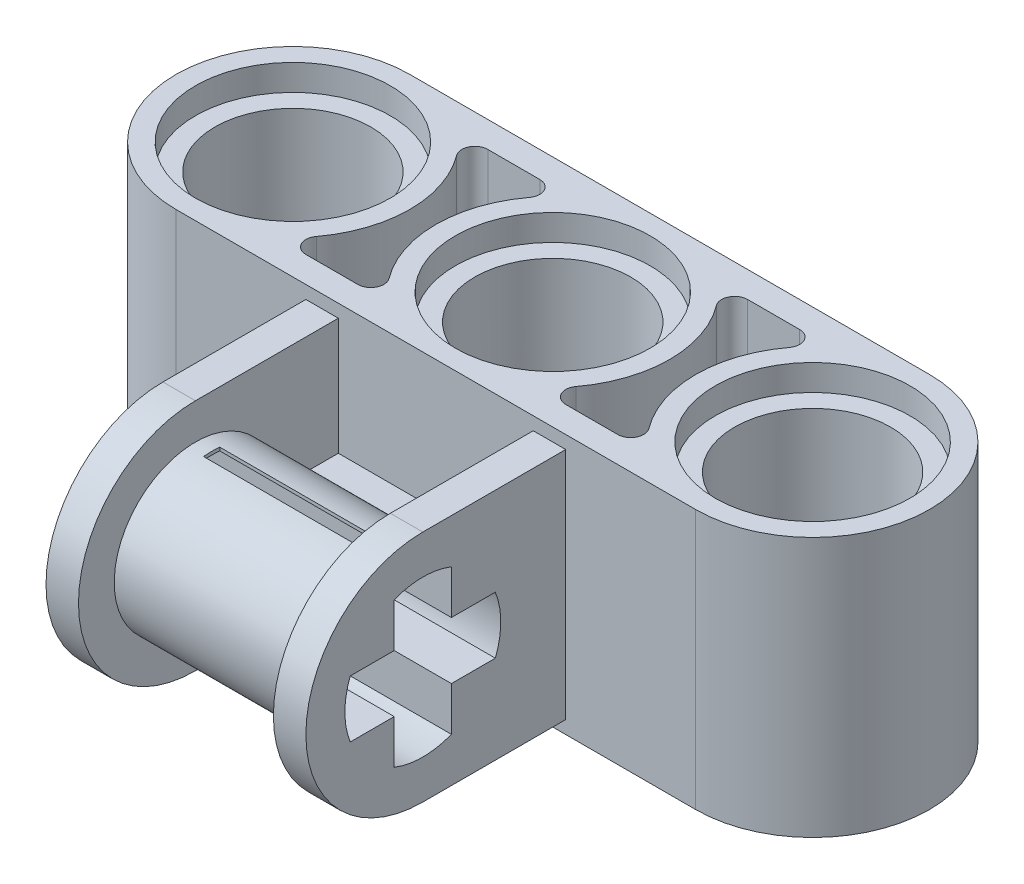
ISO-10303-21;
HEADER;
FILE_DESCRIPTION(('STEP AP214'),'2;1');
FILE_NAME('part.step','',(''),(''),'','','');
FILE_SCHEMA(('AUTOMOTIVE_DESIGN { 1 0 10303 214 1 1 1 1 }'));
ENDSEC;
DATA;
#1=APPLICATION_CONTEXT('core data for automotive mechanical design processes');
#2=APPLICATION_PROTOCOL_DEFINITION('international standard','automotive_design',2000,#1);
#3=PRODUCT_CONTEXT('',#1,'mechanical');
#4=PRODUCT('Part','Part','',(#3));
#5=PRODUCT_RELATED_PRODUCT_CATEGORY('part','',(#4));
#6=PRODUCT_DEFINITION_FORMATION('','',#4);
#7=PRODUCT_DEFINITION_CONTEXT('part definition',#1,'design');
#8=PRODUCT_DEFINITION('design','',#6,#7);
#9=PRODUCT_DEFINITION_SHAPE('','',#8);
#10=(LENGTH_UNIT() NAMED_UNIT(*) SI_UNIT(.MILLI.,.METRE.));
#11=(NAMED_UNIT(*) PLANE_ANGLE_UNIT() SI_UNIT($,.RADIAN.));
#12=(NAMED_UNIT(*) SI_UNIT($,.STERADIAN.) SOLID_ANGLE_UNIT());
#13=UNCERTAINTY_MEASURE_WITH_UNIT(LENGTH_MEASURE(1.E-05),#10,'distance_accuracy_value','');
#14=(GEOMETRIC_REPRESENTATION_CONTEXT(3) GLOBAL_UNCERTAINTY_ASSIGNED_CONTEXT((#13)) GLOBAL_UNIT_ASSIGNED_CONTEXT((#10,
#11,#12)) REPRESENTATION_CONTEXT('',''));
#15=CARTESIAN_POINT('',(0.,0.,0.));
#16=DIRECTION('',(0.,0.,1.));
#17=DIRECTION('',(1.,0.,0.));
#18=AXIS2_PLACEMENT_3D('',#15,#16,#17);
#19=CARTESIAN_POINT('',(11.,1.5,8.));
#20=DIRECTION('',(0.,1.,0.));
#21=DIRECTION('',(0.,0.,1.));
#22=AXIS2_PLACEMENT_3D('',#19,#20,#21);
#23=PLANE('',#22);
#24=DIRECTION('',(0.,0.,1.));
#25=VECTOR('',#24,1.);
#26=CARTESIAN_POINT('',(10.5,1.5,8.));
#27=LINE('',#26,#25);
#28=CARTESIAN_POINT('',(10.5,1.5,7.75));
#29=VERTEX_POINT('',#28);
#30=CARTESIAN_POINT('',(10.5,1.5,8.));
#31=VERTEX_POINT('',#30);
#32=EDGE_CURVE('E998',#29,#31,#27,.T.);
#33=ORIENTED_EDGE('',*,*,#32,.F.);
#34=DIRECTION('',(1.,0.,0.));
#35=VECTOR('',#34,1.);
#36=CARTESIAN_POINT('',(11.,1.5,7.75));
#37=LINE('',#36,#35);
#38=CARTESIAN_POINT('',(5.5,1.5,7.75));
#39=VERTEX_POINT('',#38);
#40=EDGE_CURVE('E1004',#39,#29,#37,.T.);
#41=ORIENTED_EDGE('',*,*,#40,.F.);
#42=DIRECTION('',(0.,0.,-1.));
#43=VECTOR('',#42,1.);
#44=CARTESIAN_POINT('',(5.5,1.5,8.));
#45=LINE('',#44,#43);
#46=CARTESIAN_POINT('',(5.5,1.5,8.));
#47=VERTEX_POINT('',#46);
#48=EDGE_CURVE('E1010',#47,#39,#45,.T.);
#49=ORIENTED_EDGE('',*,*,#48,.F.);
#50=DIRECTION('',(-1.,0.,0.));
#51=VECTOR('',#50,1.);
#52=CARTESIAN_POINT('',(11.,1.5,8.));
#53=LINE('',#52,#51);
#54=CARTESIAN_POINT('',(5.,1.5,8.));
#55=VERTEX_POINT('',#54);
#56=EDGE_CURVE('E902',#47,#55,#53,.T.);
#57=ORIENTED_EDGE('',*,*,#56,.T.);
#58=DIRECTION('',(0.,0.,-1.));
#59=VECTOR('',#58,1.);
#60=CARTESIAN_POINT('',(5.,1.5,8.));
#61=LINE('',#60,#59);
#62=CARTESIAN_POINT('',(5.,1.5,3.74901627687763));
#63=VERTEX_POINT('',#62);
#64=EDGE_CURVE('E915',#55,#63,#61,.T.);
#65=ORIENTED_EDGE('',*,*,#64,.T.);
#66=DIRECTION('',(-1.,0.,0.));
#67=VECTOR('',#66,1.);
#68=CARTESIAN_POINT('',(11.,1.5,3.74901627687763));
#69=LINE('',#68,#67);
#70=CARTESIAN_POINT('',(11.,1.5,3.74901627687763));
#71=VERTEX_POINT('',#70);
#72=EDGE_CURVE('E897',#71,#63,#69,.T.);
#73=ORIENTED_EDGE('',*,*,#72,.F.);
#74=DIRECTION('',(0.,0.,-1.));
#75=VECTOR('',#74,1.);
#76=CARTESIAN_POINT('',(11.,1.5,8.));
#77=LINE('',#76,#75);
#78=CARTESIAN_POINT('',(11.,1.5,8.));
#79=VERTEX_POINT('',#78);
#80=EDGE_CURVE('E906',#79,#71,#77,.T.);
#81=ORIENTED_EDGE('',*,*,#80,.F.);
#82=EDGE_CURVE('E899',#79,#31,#53,.T.);
#83=ORIENTED_EDGE('',*,*,#82,.T.);
#84=EDGE_LOOP('',(#33,#41,#49,#57,#65,#73,#81,#83));
#85=FACE_BOUND('',#84,.T.);
#86=ADVANCED_FACE('F34',(#85),#23,.F.);
#87=CARTESIAN_POINT('',(11.,4.,8.));
#88=DIRECTION('',(-1.,0.,0.));
#89=DIRECTION('',(0.,0.,1.));
#90=AXIS2_PLACEMENT_3D('',#87,#88,#89);
#91=CYLINDRICAL_SURFACE('',#90,2.5);
#92=CARTESIAN_POINT('',(10.5,4.,8.));
#93=DIRECTION('',(-1.,0.,0.));
#94=DIRECTION('',(0.,0.,1.));
#95=AXIS2_PLACEMENT_3D('',#92,#93,#94);
#96=CIRCLE('',#95,2.5);
#97=CARTESIAN_POINT('',(10.5,6.48746859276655,8.25));
#98=VERTEX_POINT('',#97);
#99=CARTESIAN_POINT('',(10.5,6.48746859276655,7.75));
#100=VERTEX_POINT('',#99);
#101=EDGE_CURVE('E997',#98,#100,#96,.T.);
#102=ORIENTED_EDGE('',*,*,#101,.F.);
#103=DIRECTION('',(-1.,0.,0.));
#104=VECTOR('',#103,1.);
#105=CARTESIAN_POINT('',(11.,6.48746859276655,8.25));
#106=LINE('',#105,#104);
#107=CARTESIAN_POINT('',(5.5,6.48746859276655,8.25));
#108=VERTEX_POINT('',#107);
#109=EDGE_CURVE('E1019',#108,#98,#106,.F.);
#110=ORIENTED_EDGE('',*,*,#109,.F.);
#111=CARTESIAN_POINT('',(5.5,4.,8.));
#112=DIRECTION('',(1.,0.,0.));
#113=DIRECTION('',(0.,0.,-1.));
#114=AXIS2_PLACEMENT_3D('',#111,#112,#113);
#115=CIRCLE('',#114,2.5);
#116=CARTESIAN_POINT('',(5.5,6.48746859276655,7.75));
#117=VERTEX_POINT('',#116);
#118=EDGE_CURVE('E478',#117,#108,#115,.T.);
#119=ORIENTED_EDGE('',*,*,#118,.F.);
#120=DIRECTION('',(-1.,0.,0.));
#121=VECTOR('',#120,1.);
#122=CARTESIAN_POINT('',(11.,6.48746859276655,7.75));
#123=LINE('',#122,#121);
#124=EDGE_CURVE('E1006',#100,#117,#123,.T.);
#125=ORIENTED_EDGE('',*,*,#124,.F.);
#126=EDGE_LOOP('',(#102,#110,#119,#125));
#127=FACE_BOUND('',#126,.T.);
#128=CARTESIAN_POINT('',(10.5,1.51253140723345,8.25));
#129=VERTEX_POINT('',#128);
#130=EDGE_CURVE('E1000',#31,#129,#96,.T.);
#131=ORIENTED_EDGE('',*,*,#130,.F.);
#132=ORIENTED_EDGE('',*,*,#82,.F.);
#133=CARTESIAN_POINT('',(11.,4.,8.));
#134=DIRECTION('',(1.,0.,0.));
#135=DIRECTION('',(0.,0.,-1.));
#136=AXIS2_PLACEMENT_3D('',#133,#134,#135);
#137=CIRCLE('',#136,2.5);
#138=CARTESIAN_POINT('',(11.,4.,5.5));
#139=VERTEX_POINT('',#138);
#140=EDGE_CURVE('E903',#139,#79,#137,.T.);
#141=ORIENTED_EDGE('',*,*,#140,.F.);
#142=DIRECTION('',(-1.,0.,0.));
#143=VECTOR('',#142,1.);
#144=CARTESIAN_POINT('',(11.,4.,5.5));
#145=LINE('',#144,#143);
#146=CARTESIAN_POINT('',(5.,4.,5.5));
#147=VERTEX_POINT('',#146);
#148=EDGE_CURVE('E981',#139,#147,#145,.T.);
#149=ORIENTED_EDGE('',*,*,#148,.T.);
#150=CARTESIAN_POINT('',(5.,4.,8.));
#151=DIRECTION('',(1.,0.,0.));
#152=DIRECTION('',(0.,0.,-1.));
#153=AXIS2_PLACEMENT_3D('',#150,#151,#152);
#154=CIRCLE('',#153,2.5);
#155=EDGE_CURVE('E912',#147,#55,#154,.T.);
#156=ORIENTED_EDGE('',*,*,#155,.T.);
#157=ORIENTED_EDGE('',*,*,#56,.F.);
#158=CARTESIAN_POINT('',(5.5,1.51253140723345,8.25));
#159=VERTEX_POINT('',#158);
#160=EDGE_CURVE('E1012',#159,#47,#115,.T.);
#161=ORIENTED_EDGE('',*,*,#160,.F.);
#162=DIRECTION('',(-1.,0.,0.));
#163=VECTOR('',#162,1.);
#164=CARTESIAN_POINT('',(11.,1.51253140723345,8.25));
#165=LINE('',#164,#163);
#166=EDGE_CURVE('E1017',#129,#159,#165,.T.);
#167=ORIENTED_EDGE('',*,*,#166,.F.);
#168=EDGE_LOOP('',(#131,#132,#141,#149,#156,#157,#161,#167));
#169=FACE_BOUND('',#168,.T.);
#170=ADVANCED_FACE('F1042',(#127,#169),#91,.T.);
#171=CARTESIAN_POINT('',(19.6,4.,8.));
#172=DIRECTION('',(-1.,0.,0.));
#173=DIRECTION('',(0.,0.,1.));
#174=AXIS2_PLACEMENT_3D('',#171,#172,#173);
#175=CYLINDRICAL_SURFACE('',#174,2.4);
#176=CARTESIAN_POINT('',(12.,4.,8.));
#177=DIRECTION('',(1.,0.,0.));
#178=DIRECTION('',(0.,0.,-1.));
#179=AXIS2_PLACEMENT_3D('',#176,#177,#178);
#180=CIRCLE('',#179,2.4);
#181=CARTESIAN_POINT('',(12.,1.76715428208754,8.88));
#182=VERTEX_POINT('',#181);
#183=CARTESIAN_POINT('',(12.,1.76715428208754,7.12));
#184=VERTEX_POINT('',#183);
#185=EDGE_CURVE('E492',#182,#184,#180,.T.);
#186=ORIENTED_EDGE('',*,*,#185,.T.);
#187=DIRECTION('',(-1.,0.,0.));
#188=VECTOR('',#187,1.);
#189=CARTESIAN_POINT('',(19.6,1.76715428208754,7.12));
#190=LINE('',#189,#188);
#191=CARTESIAN_POINT('',(4.,1.76715428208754,7.12));
#192=VERTEX_POINT('',#191);
#193=EDGE_CURVE('E940',#184,#192,#190,.T.);
#194=ORIENTED_EDGE('',*,*,#193,.T.);
#195=CARTESIAN_POINT('',(4.,4.,8.));
#196=DIRECTION('',(-1.,0.,0.));
#197=DIRECTION('',(0.,0.,1.));
#198=AXIS2_PLACEMENT_3D('',#195,#196,#197);
#199=CIRCLE('',#198,2.4);
#200=CARTESIAN_POINT('',(4.,1.76715428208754,8.88));
#201=VERTEX_POINT('',#200);
#202=EDGE_CURVE('E952',#192,#201,#199,.T.);
#203=ORIENTED_EDGE('',*,*,#202,.T.);
#204=DIRECTION('',(-1.,0.,0.));
#205=VECTOR('',#204,1.);
#206=CARTESIAN_POINT('',(19.6,1.76715428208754,8.88));
#207=LINE('',#206,#205);
#208=EDGE_CURVE('E942',#182,#201,#207,.T.);
#209=ORIENTED_EDGE('',*,*,#208,.F.);
#210=EDGE_LOOP('',(#186,#194,#203,#209));
#211=FACE_BOUND('',#210,.T.);
#212=CARTESIAN_POINT('',(10.5,4.,8.));
#213=DIRECTION('',(-1.,0.,0.));
#214=DIRECTION('',(0.,0.,1.));
#215=AXIS2_PLACEMENT_3D('',#212,#213,#214);
#216=CIRCLE('',#215,2.4);
#217=CARTESIAN_POINT('',(10.5,1.613056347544,8.25));
#218=VERTEX_POINT('',#217);
#219=CARTESIAN_POINT('',(10.5,1.613056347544,7.75));
#220=VERTEX_POINT('',#219);
#221=EDGE_CURVE('E1002',#218,#220,#216,.F.);
#222=ORIENTED_EDGE('',*,*,#221,.F.);
#223=DIRECTION('',(-1.,0.,0.));
#224=VECTOR('',#223,1.);
#225=CARTESIAN_POINT('',(19.6,1.613056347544,8.25));
#226=LINE('',#225,#224);
#227=CARTESIAN_POINT('',(5.5,1.613056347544,8.25));
#228=VERTEX_POINT('',#227);
#229=EDGE_CURVE('E1021',#228,#218,#226,.F.);
#230=ORIENTED_EDGE('',*,*,#229,.F.);
#231=CARTESIAN_POINT('',(5.5,4.,8.));
#232=DIRECTION('',(1.,0.,0.));
#233=DIRECTION('',(0.,0.,-1.));
#234=AXIS2_PLACEMENT_3D('',#231,#232,#233);
#235=CIRCLE('',#234,2.4);
#236=CARTESIAN_POINT('',(5.5,1.613056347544,7.75));
#237=VERTEX_POINT('',#236);
#238=EDGE_CURVE('E1014',#237,#228,#235,.F.);
#239=ORIENTED_EDGE('',*,*,#238,.F.);
#240=DIRECTION('',(-1.,0.,0.));
#241=VECTOR('',#240,1.);
#242=CARTESIAN_POINT('',(19.6,1.613056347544,7.74999999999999));
#243=LINE('',#242,#241);
#244=EDGE_CURVE('E1008',#220,#237,#243,.T.);
#245=ORIENTED_EDGE('',*,*,#244,.F.);
#246=EDGE_LOOP('',(#222,#230,#239,#245));
#247=FACE_BOUND('',#246,.T.);
#248=ADVANCED_FACE('F1054',(#211,#247),#175,.F.);
#249=CARTESIAN_POINT('',(19.6,4.,8.));
#250=DIRECTION('',(-1.,0.,0.));
#251=DIRECTION('',(0.,0.,1.));
#252=AXIS2_PLACEMENT_3D('',#249,#250,#251);
#253=CYLINDRICAL_SURFACE('',#252,2.4);
#254=CARTESIAN_POINT('',(12.,4.,8.));
#255=DIRECTION('',(1.,0.,0.));
#256=DIRECTION('',(0.,0.,-1.));
#257=AXIS2_PLACEMENT_3D('',#254,#255,#256);
#258=CIRCLE('',#257,2.4);
#259=CARTESIAN_POINT('',(12.,6.23284571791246,7.12));
#260=VERTEX_POINT('',#259);
#261=CARTESIAN_POINT('',(12.,6.23284571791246,8.88));
#262=VERTEX_POINT('',#261);
#263=EDGE_CURVE('E504',#260,#262,#258,.T.);
#264=ORIENTED_EDGE('',*,*,#263,.T.);
#265=DIRECTION('',(-1.,0.,0.));
#266=VECTOR('',#265,1.);
#267=CARTESIAN_POINT('',(19.6,6.23284571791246,8.88));
#268=LINE('',#267,#266);
#269=CARTESIAN_POINT('',(4.,6.23284571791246,8.88));
#270=VERTEX_POINT('',#269);
#271=EDGE_CURVE('E928',#262,#270,#268,.T.);
#272=ORIENTED_EDGE('',*,*,#271,.T.);
#273=CARTESIAN_POINT('',(4.,4.,8.));
#274=DIRECTION('',(-1.,0.,0.));
#275=DIRECTION('',(0.,0.,1.));
#276=AXIS2_PLACEMENT_3D('',#273,#274,#275);
#277=CIRCLE('',#276,2.4);
#278=CARTESIAN_POINT('',(4.,6.23284571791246,7.12));
#279=VERTEX_POINT('',#278);
#280=EDGE_CURVE('E970',#270,#279,#277,.T.);
#281=ORIENTED_EDGE('',*,*,#280,.T.);
#282=DIRECTION('',(-1.,0.,0.));
#283=VECTOR('',#282,1.);
#284=CARTESIAN_POINT('',(19.6,6.23284571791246,7.12));
#285=LINE('',#284,#283);
#286=EDGE_CURVE('E930',#260,#279,#285,.T.);
#287=ORIENTED_EDGE('',*,*,#286,.F.);
#288=EDGE_LOOP('',(#264,#272,#281,#287));
#289=FACE_BOUND('',#288,.T.);
#290=CARTESIAN_POINT('',(10.5,4.,8.));
#291=DIRECTION('',(-1.,0.,0.));
#292=DIRECTION('',(0.,0.,1.));
#293=AXIS2_PLACEMENT_3D('',#290,#291,#292);
#294=CIRCLE('',#293,2.4);
#295=CARTESIAN_POINT('',(10.5,6.386943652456,7.75));
#296=VERTEX_POINT('',#295);
#297=CARTESIAN_POINT('',(10.5,6.386943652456,8.25));
#298=VERTEX_POINT('',#297);
#299=EDGE_CURVE('E11',#296,#298,#294,.F.);
#300=ORIENTED_EDGE('',*,*,#299,.F.);
#301=DIRECTION('',(-1.,0.,0.));
#302=VECTOR('',#301,1.);
#303=CARTESIAN_POINT('',(19.6,6.386943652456,7.74999999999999));
#304=LINE('',#303,#302);
#305=CARTESIAN_POINT('',(5.5,6.386943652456,7.75));
#306=VERTEX_POINT('',#305);
#307=EDGE_CURVE('E42',#306,#296,#304,.F.);
#308=ORIENTED_EDGE('',*,*,#307,.F.);
#309=CARTESIAN_POINT('',(5.5,4.,8.));
#310=DIRECTION('',(1.,0.,0.));
#311=DIRECTION('',(0.,0.,-1.));
#312=AXIS2_PLACEMENT_3D('',#309,#310,#311);
#313=CIRCLE('',#312,2.4);
#314=CARTESIAN_POINT('',(5.5,6.386943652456,8.25));
#315=VERTEX_POINT('',#314);
#316=EDGE_CURVE('E470',#315,#306,#313,.F.);
#317=ORIENTED_EDGE('',*,*,#316,.F.);
#318=DIRECTION('',(-1.,0.,0.));
#319=VECTOR('',#318,1.);
#320=CARTESIAN_POINT('',(19.6,6.386943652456,8.25));
#321=LINE('',#320,#319);
#322=EDGE_CURVE('E463',#298,#315,#321,.T.);
#323=ORIENTED_EDGE('',*,*,#322,.F.);
#324=EDGE_LOOP('',(#300,#308,#317,#323));
#325=FACE_BOUND('',#324,.T.);
#326=ADVANCED_FACE('F484',(#289,#325),#253,.F.);
#327=CARTESIAN_POINT('',(4.,7.6,8.));
#328=DIRECTION('',(0.,1.,0.));
#329=DIRECTION('',(0.,0.,1.));
#330=AXIS2_PLACEMENT_3D('',#327,#328,#329);
#331=PLANE('',#330);
#332=DIRECTION('',(0.,0.,-1.));
#333=VECTOR('',#332,1.);
#334=CARTESIAN_POINT('',(5.,7.6,8.));
#335=LINE('',#334,#333);
#336=CARTESIAN_POINT('',(5.,7.6,8.));
#337=VERTEX_POINT('',#336);
#338=CARTESIAN_POINT('',(5.,7.6,3.6));
#339=VERTEX_POINT('',#338);
#340=EDGE_CURVE('E892',#337,#339,#335,.T.);
#341=ORIENTED_EDGE('',*,*,#340,.T.);
#342=DIRECTION('',(1.,0.,0.));
#343=VECTOR('',#342,1.);
#344=CARTESIAN_POINT('',(4.,7.6,3.6));
#345=LINE('',#344,#343);
#346=CARTESIAN_POINT('',(4.,7.6,3.6));
#347=VERTEX_POINT('',#346);
#348=EDGE_CURVE('E859',#347,#339,#345,.T.);
#349=ORIENTED_EDGE('',*,*,#348,.F.);
#350=DIRECTION('',(0.,0.,1.));
#351=VECTOR('',#350,1.);
#352=CARTESIAN_POINT('',(4.,7.6,8.));
#353=LINE('',#352,#351);
#354=CARTESIAN_POINT('',(4.,7.6,8.));
#355=VERTEX_POINT('',#354);
#356=EDGE_CURVE('E865',#347,#355,#353,.T.);
#357=ORIENTED_EDGE('',*,*,#356,.T.);
#358=DIRECTION('',(1.,0.,0.));
#359=VECTOR('',#358,1.);
#360=CARTESIAN_POINT('',(4.,7.6,8.));
#361=LINE('',#360,#359);
#362=EDGE_CURVE('E850',#355,#337,#361,.T.);
#363=ORIENTED_EDGE('',*,*,#362,.T.);
#364=EDGE_LOOP('',(#341,#349,#357,#363));
#365=FACE_BOUND('',#364,.T.);
#366=ADVANCED_FACE('F1099',(#365),#331,.T.);
#367=CARTESIAN_POINT('',(4.,4.,8.));
#368=DIRECTION('',(1.,0.,0.));
#369=DIRECTION('',(0.,0.,-1.));
#370=AXIS2_PLACEMENT_3D('',#367,#368,#369);
#371=CYLINDRICAL_SURFACE('',#370,3.6);
#372=DIRECTION('',(1.,0.,0.));
#373=VECTOR('',#372,1.);
#374=CARTESIAN_POINT('',(4.,0.4,8.));
#375=LINE('',#374,#373);
#376=CARTESIAN_POINT('',(4.,0.4,8.));
#377=VERTEX_POINT('',#376);
#378=CARTESIAN_POINT('',(5.,0.4,8.));
#379=VERTEX_POINT('',#378);
#380=EDGE_CURVE('E851',#377,#379,#375,.T.);
#381=ORIENTED_EDGE('',*,*,#380,.T.);
#382=CARTESIAN_POINT('',(5.,4.,8.));
#383=DIRECTION('',(1.,0.,0.));
#384=DIRECTION('',(0.,0.,-1.));
#385=AXIS2_PLACEMENT_3D('',#382,#383,#384);
#386=CIRCLE('',#385,3.6);
#387=EDGE_CURVE('E894',#379,#337,#386,.F.);
#388=ORIENTED_EDGE('',*,*,#387,.T.);
#389=ORIENTED_EDGE('',*,*,#362,.F.);
#390=CARTESIAN_POINT('',(4.,4.,8.));
#391=DIRECTION('',(1.,0.,0.));
#392=DIRECTION('',(0.,0.,-1.));
#393=AXIS2_PLACEMENT_3D('',#390,#391,#392);
#394=CIRCLE('',#393,3.6);
#395=EDGE_CURVE('E874',#355,#377,#394,.T.);
#396=ORIENTED_EDGE('',*,*,#395,.T.);
#397=EDGE_LOOP('',(#381,#388,#389,#396));
#398=FACE_BOUND('',#397,.T.);
#399=ADVANCED_FACE('F1105',(#398),#371,.T.);
#400=CARTESIAN_POINT('',(32.,8.,3.6));
#401=DIRECTION('',(0.,0.,-1.));
#402=DIRECTION('',(-1.,0.,0.));
#403=AXIS2_PLACEMENT_3D('',#400,#401,#402);
#404=PLANE('',#403);
#405=DIRECTION('',(0.,1.,0.));
#406=VECTOR('',#405,1.);
#407=CARTESIAN_POINT('',(11.,4.,3.6));
#408=LINE('',#407,#406);
#409=CARTESIAN_POINT('',(11.,4.,3.6));
#410=VERTEX_POINT('',#409);
#411=CARTESIAN_POINT('',(11.,7.6,3.6));
#412=VERTEX_POINT('',#411);
#413=EDGE_CURVE('E986',#410,#412,#408,.T.);
#414=ORIENTED_EDGE('',*,*,#413,.T.);
#415=CARTESIAN_POINT('',(12.,7.6,3.6));
#416=VERTEX_POINT('',#415);
#417=EDGE_CURVE('E858',#412,#416,#345,.T.);
#418=ORIENTED_EDGE('',*,*,#417,.T.);
#419=DIRECTION('',(0.,1.,0.));
#420=VECTOR('',#419,1.);
#421=CARTESIAN_POINT('',(12.,0.4,3.6));
#422=LINE('',#421,#420);
#423=CARTESIAN_POINT('',(12.,0.4,3.6));
#424=VERTEX_POINT('',#423);
#425=EDGE_CURVE('E880',#424,#416,#422,.T.);
#426=ORIENTED_EDGE('',*,*,#425,.F.);
#427=DIRECTION('',(1.,0.,0.));
#428=VECTOR('',#427,1.);
#429=CARTESIAN_POINT('',(4.,0.4,3.6));
#430=LINE('',#429,#428);
#431=CARTESIAN_POINT('',(4.,0.4,3.6));
#432=VERTEX_POINT('',#431);
#433=EDGE_CURVE('E854',#432,#424,#430,.T.);
#434=ORIENTED_EDGE('',*,*,#433,.F.);
#435=DIRECTION('',(0.,1.,0.));
#436=VECTOR('',#435,1.);
#437=CARTESIAN_POINT('',(4.,0.4,3.6));
#438=LINE('',#437,#436);
#439=EDGE_CURVE('E868',#432,#347,#438,.T.);
#440=ORIENTED_EDGE('',*,*,#439,.T.);
#441=ORIENTED_EDGE('',*,*,#348,.T.);
#442=DIRECTION('',(0.,1.,0.));
#443=VECTOR('',#442,1.);
#444=CARTESIAN_POINT('',(5.,4.,3.6));
#445=LINE('',#444,#443);
#446=CARTESIAN_POINT('',(5.,4.,3.6));
#447=VERTEX_POINT('',#446);
#448=EDGE_CURVE('E991',#447,#339,#445,.T.);
#449=ORIENTED_EDGE('',*,*,#448,.F.);
#450=DIRECTION('',(-1.,0.,0.));
#451=VECTOR('',#450,1.);
#452=CARTESIAN_POINT('',(11.,4.,3.6));
#453=LINE('',#452,#451);
#454=EDGE_CURVE('E984',#410,#447,#453,.T.);
#455=ORIENTED_EDGE('',*,*,#454,.F.);
#456=EDGE_LOOP('',(#414,#418,#426,#434,#440,#441,#449,#455));
#457=FACE_BOUND('',#456,.T.);
#458=DIRECTION('',(1.,0.,0.));
#459=VECTOR('',#458,1.);
#460=CARTESIAN_POINT('',(32.,0.,3.6));
#461=LINE('',#460,#459);
#462=CARTESIAN_POINT('',(0.,0.,3.6));
#463=VERTEX_POINT('',#462);
#464=CARTESIAN_POINT('',(16.,0.,3.6));
#465=VERTEX_POINT('',#464);
#466=EDGE_CURVE('E550',#463,#465,#461,.T.);
#467=ORIENTED_EDGE('',*,*,#466,.T.);
#468=DIRECTION('',(0.,-1.,0.));
#469=VECTOR('',#468,1.);
#470=CARTESIAN_POINT('',(16.,28.8806130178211,3.6));
#471=LINE('',#470,#469);
#472=CARTESIAN_POINT('',(16.,8.,3.6));
#473=VERTEX_POINT('',#472);
#474=EDGE_CURVE('E728',#473,#465,#471,.T.);
#475=ORIENTED_EDGE('',*,*,#474,.F.);
#476=DIRECTION('',(1.,0.,0.));
#477=VECTOR('',#476,1.);
#478=CARTESIAN_POINT('',(32.,8.,3.6));
#479=LINE('',#478,#477);
#480=CARTESIAN_POINT('',(0.,8.,3.6));
#481=VERTEX_POINT('',#480);
#482=EDGE_CURVE('E556',#481,#473,#479,.T.);
#483=ORIENTED_EDGE('',*,*,#482,.F.);
#484=DIRECTION('',(0.,-1.,0.));
#485=VECTOR('',#484,1.);
#486=CARTESIAN_POINT('',(0.,8.,3.6));
#487=LINE('',#486,#485);
#488=EDGE_CURVE('E518',#481,#463,#487,.T.);
#489=ORIENTED_EDGE('',*,*,#488,.T.);
#490=EDGE_LOOP('',(#467,#475,#483,#489));
#491=FACE_BOUND('',#490,.T.);
#492=ADVANCED_FACE('F1095',(#457,#491),#404,.F.);
#493=CARTESIAN_POINT('',(0.,8.,-3.6));
#494=DIRECTION('',(0.,0.,1.));
#495=DIRECTION('',(1.,0.,0.));
#496=AXIS2_PLACEMENT_3D('',#493,#494,#495);
#497=PLANE('',#496);
#498=DIRECTION('',(0.,-1.,0.));
#499=VECTOR('',#498,1.);
#500=CARTESIAN_POINT('',(16.,28.8806130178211,-3.6));
#501=LINE('',#500,#499);
#502=CARTESIAN_POINT('',(16.,8.,-3.6));
#503=VERTEX_POINT('',#502);
#504=CARTESIAN_POINT('',(16.,0.,-3.6));
#505=VERTEX_POINT('',#504);
#506=EDGE_CURVE('E847',#503,#505,#501,.T.);
#507=ORIENTED_EDGE('',*,*,#506,.T.);
#508=DIRECTION('',(-1.,0.,0.));
#509=VECTOR('',#508,1.);
#510=CARTESIAN_POINT('',(0.,0.,-3.6));
#511=LINE('',#510,#509);
#512=CARTESIAN_POINT('',(0.,0.,-3.6));
#513=VERTEX_POINT('',#512);
#514=EDGE_CURVE('E547',#505,#513,#511,.T.);
#515=ORIENTED_EDGE('',*,*,#514,.T.);
#516=DIRECTION('',(0.,-1.,0.));
#517=VECTOR('',#516,1.);
#518=CARTESIAN_POINT('',(0.,8.,-3.6));
#519=LINE('',#518,#517);
#520=CARTESIAN_POINT('',(0.,8.,-3.6));
#521=VERTEX_POINT('',#520);
#522=EDGE_CURVE('E543',#521,#513,#519,.T.);
#523=ORIENTED_EDGE('',*,*,#522,.F.);
#524=DIRECTION('',(-1.,0.,0.));
#525=VECTOR('',#524,1.);
#526=CARTESIAN_POINT('',(0.,8.,-3.6));
#527=LINE('',#526,#525);
#528=EDGE_CURVE('E546',#503,#521,#527,.T.);
#529=ORIENTED_EDGE('',*,*,#528,.F.);
#530=EDGE_LOOP('',(#507,#515,#523,#529));
#531=FACE_BOUND('',#530,.T.);
#532=ADVANCED_FACE('F1112',(#531),#497,.F.);
#533=CARTESIAN_POINT('',(0.,0.,0.));
#534=DIRECTION('',(0.,1.,0.));
#535=DIRECTION('',(0.,0.,1.));
#536=AXIS2_PLACEMENT_3D('',#533,#534,#535);
#537=PLANE('',#536);
#538=CARTESIAN_POINT('',(11.2,0.,2.4));
#539=DIRECTION('',(0.,1.,0.));
#540=DIRECTION('',(0.,0.,-1.));
#541=AXIS2_PLACEMENT_3D('',#538,#539,#540);
#542=CIRCLE('',#541,0.4);
#543=CARTESIAN_POINT('',(10.88,0.,2.16));
#544=VERTEX_POINT('',#543);
#545=CARTESIAN_POINT('',(11.2,0.,2.8));
#546=VERTEX_POINT('',#545);
#547=EDGE_CURVE('E727',#544,#546,#542,.T.);
#548=ORIENTED_EDGE('',*,*,#547,.T.);
#549=DIRECTION('',(1.,0.,0.));
#550=VECTOR('',#549,1.);
#551=CARTESIAN_POINT('',(12.8,0.,2.8));
#552=LINE('',#551,#550);
#553=CARTESIAN_POINT('',(12.8,0.,2.8));
#554=VERTEX_POINT('',#553);
#555=EDGE_CURVE('E749',#546,#554,#552,.T.);
#556=ORIENTED_EDGE('',*,*,#555,.T.);
#557=CARTESIAN_POINT('',(12.8,0.,2.4));
#558=DIRECTION('',(0.,1.,0.));
#559=DIRECTION('',(0.,0.,1.));
#560=AXIS2_PLACEMENT_3D('',#557,#558,#559);
#561=CIRCLE('',#560,0.4);
#562=CARTESIAN_POINT('',(13.12,0.,2.16));
#563=VERTEX_POINT('',#562);
#564=EDGE_CURVE('E753',#554,#563,#561,.T.);
#565=ORIENTED_EDGE('',*,*,#564,.T.);
#566=CARTESIAN_POINT('',(16.,0.,0.));
#567=DIRECTION('',(0.,-1.,0.));
#568=DIRECTION('',(0.,0.,1.));
#569=AXIS2_PLACEMENT_3D('',#566,#567,#568);
#570=CIRCLE('',#569,3.6);
#571=CARTESIAN_POINT('',(13.12,0.,-2.16));
#572=VERTEX_POINT('',#571);
#573=EDGE_CURVE('E756',#563,#572,#570,.T.);
#574=ORIENTED_EDGE('',*,*,#573,.T.);
#575=CARTESIAN_POINT('',(12.8,0.,-2.4));
#576=DIRECTION('',(0.,1.,0.));
#577=DIRECTION('',(0.,0.,-1.));
#578=AXIS2_PLACEMENT_3D('',#575,#576,#577);
#579=CIRCLE('',#578,0.4);
#580=CARTESIAN_POINT('',(12.8,0.,-2.8));
#581=VERTEX_POINT('',#580);
#582=EDGE_CURVE('E759',#572,#581,#579,.T.);
#583=ORIENTED_EDGE('',*,*,#582,.T.);
#584=DIRECTION('',(-1.,0.,0.));
#585=VECTOR('',#584,1.);
#586=CARTESIAN_POINT('',(11.2,0.,-2.8));
#587=LINE('',#586,#585);
#588=CARTESIAN_POINT('',(11.2,0.,-2.8));
#589=VERTEX_POINT('',#588);
#590=EDGE_CURVE('E762',#581,#589,#587,.T.);
#591=ORIENTED_EDGE('',*,*,#590,.T.);
#592=CARTESIAN_POINT('',(11.2,0.,-2.4));
#593=DIRECTION('',(0.,1.,0.));
#594=DIRECTION('',(0.,0.,1.));
#595=AXIS2_PLACEMENT_3D('',#592,#593,#594);
#596=CIRCLE('',#595,0.4);
#597=CARTESIAN_POINT('',(10.88,0.,-2.16));
#598=VERTEX_POINT('',#597);
#599=EDGE_CURVE('E765',#589,#598,#596,.T.);
#600=ORIENTED_EDGE('',*,*,#599,.T.);
#601=CARTESIAN_POINT('',(8.,0.,0.));
#602=DIRECTION('',(0.,-1.,0.));
#603=DIRECTION('',(0.,0.,1.));
#604=AXIS2_PLACEMENT_3D('',#601,#602,#603);
#605=CIRCLE('',#604,3.6);
#606=EDGE_CURVE('E768',#598,#544,#605,.T.);
#607=ORIENTED_EDGE('',*,*,#606,.T.);
#608=EDGE_LOOP('',(#548,#556,#565,#574,#583,#591,#600,#607));
#609=FACE_BOUND('',#608,.T.);
#610=CARTESIAN_POINT('',(0.,0.,0.));
#611=DIRECTION('',(0.,1.,0.));
#612=DIRECTION('',(0.,0.,1.));
#613=AXIS2_PLACEMENT_3D('',#610,#611,#612);
#614=CIRCLE('',#613,3.);
#615=CARTESIAN_POINT('',(0.,0.,3.));
#616=VERTEX_POINT('',#615);
#617=EDGE_CURVE('E720',#616,#616,#614,.T.);
#618=ORIENTED_EDGE('',*,*,#617,.T.);
#619=EDGE_LOOP('',(#618));
#620=FACE_BOUND('',#619,.T.);
#621=CARTESIAN_POINT('',(8.,0.,0.));
#622=DIRECTION('',(0.,1.,0.));
#623=DIRECTION('',(0.,0.,1.));
#624=AXIS2_PLACEMENT_3D('',#621,#622,#623);
#625=CIRCLE('',#624,3.);
#626=CARTESIAN_POINT('',(8.,0.,3.));
#627=VERTEX_POINT('',#626);
#628=EDGE_CURVE('E714',#627,#627,#625,.T.);
#629=ORIENTED_EDGE('',*,*,#628,.T.);
#630=EDGE_LOOP('',(#629));
#631=FACE_BOUND('',#630,.T.);
#632=CARTESIAN_POINT('',(16.,0.,0.));
#633=DIRECTION('',(0.,1.,0.));
#634=DIRECTION('',(0.,0.,1.));
#635=AXIS2_PLACEMENT_3D('',#632,#633,#634);
#636=CIRCLE('',#635,3.);
#637=CARTESIAN_POINT('',(16.,0.,3.));
#638=VERTEX_POINT('',#637);
#639=EDGE_CURVE('E707',#638,#638,#636,.T.);
#640=ORIENTED_EDGE('',*,*,#639,.T.);
#641=EDGE_LOOP('',(#640));
#642=FACE_BOUND('',#641,.T.);
#643=ORIENTED_EDGE('',*,*,#514,.F.);
#644=CARTESIAN_POINT('',(16.,0.,0.));
#645=DIRECTION('',(0.,-1.,0.));
#646=DIRECTION('',(0.,0.,1.));
#647=AXIS2_PLACEMENT_3D('',#644,#645,#646);
#648=CIRCLE('',#647,3.6);
#649=EDGE_CURVE('E725',#505,#465,#648,.T.);
#650=ORIENTED_EDGE('',*,*,#649,.T.);
#651=ORIENTED_EDGE('',*,*,#466,.F.);
#652=CARTESIAN_POINT('',(0.,0.,0.));
#653=DIRECTION('',(0.,1.,0.));
#654=DIRECTION('',(0.,0.,1.));
#655=AXIS2_PLACEMENT_3D('',#652,#653,#654);
#656=CIRCLE('',#655,3.6);
#657=EDGE_CURVE('E533',#513,#463,#656,.T.);
#658=ORIENTED_EDGE('',*,*,#657,.F.);
#659=EDGE_LOOP('',(#643,#650,#651,#658));
#660=FACE_BOUND('',#659,.T.);
#661=CARTESIAN_POINT('',(3.2,0.,2.4));
#662=DIRECTION('',(0.,1.,0.));
#663=DIRECTION('',(0.,0.,-1.));
#664=AXIS2_PLACEMENT_3D('',#661,#662,#663);
#665=CIRCLE('',#664,0.4);
#666=CARTESIAN_POINT('',(2.88,0.,2.16));
#667=VERTEX_POINT('',#666);
#668=CARTESIAN_POINT('',(3.2,0.,2.8));
#669=VERTEX_POINT('',#668);
#670=EDGE_CURVE('E748',#667,#669,#665,.T.);
#671=ORIENTED_EDGE('',*,*,#670,.T.);
#672=DIRECTION('',(1.,0.,0.));
#673=VECTOR('',#672,1.);
#674=CARTESIAN_POINT('',(4.8,0.,2.8));
#675=LINE('',#674,#673);
#676=CARTESIAN_POINT('',(4.8,0.,2.8));
#677=VERTEX_POINT('',#676);
#678=EDGE_CURVE('E806',#669,#677,#675,.T.);
#679=ORIENTED_EDGE('',*,*,#678,.T.);
#680=CARTESIAN_POINT('',(4.8,0.,2.4));
#681=DIRECTION('',(0.,1.,0.));
#682=DIRECTION('',(0.,0.,1.));
#683=AXIS2_PLACEMENT_3D('',#680,#681,#682);
#684=CIRCLE('',#683,0.4);
#685=CARTESIAN_POINT('',(5.12,0.,2.16));
#686=VERTEX_POINT('',#685);
#687=EDGE_CURVE('E810',#677,#686,#684,.T.);
#688=ORIENTED_EDGE('',*,*,#687,.T.);
#689=CARTESIAN_POINT('',(8.,0.,0.));
#690=DIRECTION('',(0.,-1.,0.));
#691=DIRECTION('',(0.,0.,1.));
#692=AXIS2_PLACEMENT_3D('',#689,#690,#691);
#693=CIRCLE('',#692,3.6);
#694=CARTESIAN_POINT('',(5.12,0.,-2.16));
#695=VERTEX_POINT('',#694);
#696=EDGE_CURVE('E813',#686,#695,#693,.T.);
#697=ORIENTED_EDGE('',*,*,#696,.T.);
#698=CARTESIAN_POINT('',(4.8,0.,-2.4));
#699=DIRECTION('',(0.,1.,0.));
#700=DIRECTION('',(0.,0.,-1.));
#701=AXIS2_PLACEMENT_3D('',#698,#699,#700);
#702=CIRCLE('',#701,0.4);
#703=CARTESIAN_POINT('',(4.8,0.,-2.8));
#704=VERTEX_POINT('',#703);
#705=EDGE_CURVE('E816',#695,#704,#702,.T.);
#706=ORIENTED_EDGE('',*,*,#705,.T.);
#707=DIRECTION('',(-1.,0.,0.));
#708=VECTOR('',#707,1.);
#709=CARTESIAN_POINT('',(3.2,0.,-2.8));
#710=LINE('',#709,#708);
#711=CARTESIAN_POINT('',(3.2,0.,-2.8));
#712=VERTEX_POINT('',#711);
#713=EDGE_CURVE('E819',#704,#712,#710,.T.);
#714=ORIENTED_EDGE('',*,*,#713,.T.);
#715=CARTESIAN_POINT('',(3.2,0.,-2.4));
#716=DIRECTION('',(0.,1.,0.));
#717=DIRECTION('',(0.,0.,1.));
#718=AXIS2_PLACEMENT_3D('',#715,#716,#717);
#719=CIRCLE('',#718,0.4);
#720=CARTESIAN_POINT('',(2.88,0.,-2.16));
#721=VERTEX_POINT('',#720);
#722=EDGE_CURVE('E822',#712,#721,#719,.T.);
#723=ORIENTED_EDGE('',*,*,#722,.T.);
#724=CARTESIAN_POINT('',(0.,0.,0.));
#725=DIRECTION('',(0.,-1.,0.));
#726=DIRECTION('',(0.,0.,1.));
#727=AXIS2_PLACEMENT_3D('',#724,#725,#726);
#728=CIRCLE('',#727,3.6);
#729=EDGE_CURVE('E825',#721,#667,#728,.T.);
#730=ORIENTED_EDGE('',*,*,#729,.T.);
#731=EDGE_LOOP('',(#671,#679,#688,#697,#706,#714,#723,#730));
#732=FACE_BOUND('',#731,.T.);
#733=ADVANCED_FACE('F1841',(#609,#620,#631,#642,#660,#732),#537,.F.);
#734=CARTESIAN_POINT('',(0.,8.,0.));
#735=DIRECTION('',(0.,-1.,0.));
#736=DIRECTION('',(0.,0.,-1.));
#737=AXIS2_PLACEMENT_3D('',#734,#735,#736);
#738=CYLINDRICAL_SURFACE('',#737,2.4);
#739=CARTESIAN_POINT('',(0.,7.2,0.));
#740=DIRECTION('',(0.,1.,0.));
#741=DIRECTION('',(0.,0.,1.));
#742=AXIS2_PLACEMENT_3D('',#739,#740,#741);
#743=CIRCLE('',#742,2.4);
#744=CARTESIAN_POINT('',(0.,7.2,2.4));
#745=VERTEX_POINT('',#744);
#746=EDGE_CURVE('E530',#745,#745,#743,.T.);
#747=ORIENTED_EDGE('',*,*,#746,.T.);
#748=EDGE_LOOP('',(#747));
#749=FACE_BOUND('',#748,.T.);
#750=CARTESIAN_POINT('',(0.,0.8,0.));
#751=DIRECTION('',(0.,-1.,0.));
#752=DIRECTION('',(0.,0.,-1.));
#753=AXIS2_PLACEMENT_3D('',#750,#751,#752);
#754=CIRCLE('',#753,2.4);
#755=CARTESIAN_POINT('',(0.,0.8,-2.4));
#756=VERTEX_POINT('',#755);
#757=EDGE_CURVE('E519',#756,#756,#754,.T.);
#758=ORIENTED_EDGE('',*,*,#757,.T.);
#759=EDGE_LOOP('',(#758));
#760=FACE_BOUND('',#759,.T.);
#761=ADVANCED_FACE('F1834',(#749,#760),#738,.F.);
#762=CARTESIAN_POINT('',(8.,8.,0.));
#763=DIRECTION('',(0.,-1.,0.));
#764=DIRECTION('',(0.,0.,-1.));
#765=AXIS2_PLACEMENT_3D('',#762,#763,#764);
#766=CYLINDRICAL_SURFACE('',#765,2.4);
#767=CARTESIAN_POINT('',(8.,7.2,0.));
#768=DIRECTION('',(0.,1.,0.));
#769=DIRECTION('',(0.,0.,1.));
#770=AXIS2_PLACEMENT_3D('',#767,#768,#769);
#771=CIRCLE('',#770,2.4);
#772=CARTESIAN_POINT('',(8.,7.2,2.4));
#773=VERTEX_POINT('',#772);
#774=EDGE_CURVE('E534',#773,#773,#771,.T.);
#775=ORIENTED_EDGE('',*,*,#774,.T.);
#776=EDGE_LOOP('',(#775));
#777=FACE_BOUND('',#776,.T.);
#778=CARTESIAN_POINT('',(8.,0.8,0.));
#779=DIRECTION('',(0.,-1.,0.));
#780=DIRECTION('',(0.,0.,-1.));
#781=AXIS2_PLACEMENT_3D('',#778,#779,#780);
#782=CIRCLE('',#781,2.4);
#783=CARTESIAN_POINT('',(8.,0.8,-2.4));
#784=VERTEX_POINT('',#783);
#785=EDGE_CURVE('E523',#784,#784,#782,.T.);
#786=ORIENTED_EDGE('',*,*,#785,.T.);
#787=EDGE_LOOP('',(#786));
#788=FACE_BOUND('',#787,.T.);
#789=ADVANCED_FACE('F1826',(#777,#788),#766,.F.);
#790=CARTESIAN_POINT('',(16.,8.,0.));
#791=DIRECTION('',(0.,-1.,0.));
#792=DIRECTION('',(0.,0.,-1.));
#793=AXIS2_PLACEMENT_3D('',#790,#791,#792);
#794=CYLINDRICAL_SURFACE('',#793,2.4);
#795=CARTESIAN_POINT('',(16.,7.2,0.));
#796=DIRECTION('',(0.,1.,0.));
#797=DIRECTION('',(0.,0.,1.));
#798=AXIS2_PLACEMENT_3D('',#795,#796,#797);
#799=CIRCLE('',#798,2.4);
#800=CARTESIAN_POINT('',(16.,7.2,2.4));
#801=VERTEX_POINT('',#800);
#802=EDGE_CURVE('E537',#801,#801,#799,.T.);
#803=ORIENTED_EDGE('',*,*,#802,.T.);
#804=EDGE_LOOP('',(#803));
#805=FACE_BOUND('',#804,.T.);
#806=CARTESIAN_POINT('',(16.,0.8,0.));
#807=DIRECTION('',(0.,-1.,0.));
#808=DIRECTION('',(0.,0.,-1.));
#809=AXIS2_PLACEMENT_3D('',#806,#807,#808);
#810=CIRCLE('',#809,2.4);
#811=CARTESIAN_POINT('',(16.,0.8,-2.4));
#812=VERTEX_POINT('',#811);
#813=EDGE_CURVE('E526',#812,#812,#810,.T.);
#814=ORIENTED_EDGE('',*,*,#813,.T.);
#815=EDGE_LOOP('',(#814));
#816=FACE_BOUND('',#815,.T.);
#817=ADVANCED_FACE('F1818',(#805,#816),#794,.F.);
#818=CARTESIAN_POINT('',(0.,8.,0.));
#819=DIRECTION('',(0.,1.,0.));
#820=DIRECTION('',(0.,0.,1.));
#821=AXIS2_PLACEMENT_3D('',#818,#819,#820);
#822=PLANE('',#821);
#823=CARTESIAN_POINT('',(16.,8.,0.));
#824=DIRECTION('',(0.,-1.,0.));
#825=DIRECTION('',(0.,0.,1.));
#826=AXIS2_PLACEMENT_3D('',#823,#824,#825);
#827=CIRCLE('',#826,3.6);
#828=EDGE_CURVE('E522',#503,#473,#827,.T.);
#829=ORIENTED_EDGE('',*,*,#828,.F.);
#830=ORIENTED_EDGE('',*,*,#528,.T.);
#831=CARTESIAN_POINT('',(0.,8.,0.));
#832=DIRECTION('',(0.,1.,0.));
#833=DIRECTION('',(0.,0.,1.));
#834=AXIS2_PLACEMENT_3D('',#831,#832,#833);
#835=CIRCLE('',#834,3.6);
#836=EDGE_CURVE('E549',#521,#481,#835,.T.);
#837=ORIENTED_EDGE('',*,*,#836,.T.);
#838=ORIENTED_EDGE('',*,*,#482,.T.);
#839=EDGE_LOOP('',(#829,#830,#837,#838));
#840=FACE_BOUND('',#839,.T.);
#841=CARTESIAN_POINT('',(3.2,8.,2.4));
#842=DIRECTION('',(0.,1.,0.));
#843=DIRECTION('',(0.,0.,-1.));
#844=AXIS2_PLACEMENT_3D('',#841,#842,#843);
#845=CIRCLE('',#844,0.4);
#846=CARTESIAN_POINT('',(2.88,8.,2.16));
#847=VERTEX_POINT('',#846);
#848=CARTESIAN_POINT('',(3.2,8.,2.8));
#849=VERTEX_POINT('',#848);
#850=EDGE_CURVE('E599',#847,#849,#845,.T.);
#851=ORIENTED_EDGE('',*,*,#850,.F.);
#852=CARTESIAN_POINT('',(0.,8.,0.));
#853=DIRECTION('',(0.,-1.,0.));
#854=DIRECTION('',(0.,0.,1.));
#855=AXIS2_PLACEMENT_3D('',#852,#853,#854);
#856=CIRCLE('',#855,3.6);
#857=CARTESIAN_POINT('',(2.88,8.,-2.16));
#858=VERTEX_POINT('',#857);
#859=EDGE_CURVE('E662',#858,#847,#856,.T.);
#860=ORIENTED_EDGE('',*,*,#859,.F.);
#861=CARTESIAN_POINT('',(3.2,8.,-2.4));
#862=DIRECTION('',(0.,1.,0.));
#863=DIRECTION('',(0.,0.,1.));
#864=AXIS2_PLACEMENT_3D('',#861,#862,#863);
#865=CIRCLE('',#864,0.4);
#866=CARTESIAN_POINT('',(3.2,8.,-2.8));
#867=VERTEX_POINT('',#866);
#868=EDGE_CURVE('E666',#867,#858,#865,.T.);
#869=ORIENTED_EDGE('',*,*,#868,.F.);
#870=DIRECTION('',(-1.,0.,0.));
#871=VECTOR('',#870,1.);
#872=CARTESIAN_POINT('',(3.2,8.,-2.8));
#873=LINE('',#872,#871);
#874=CARTESIAN_POINT('',(4.8,8.,-2.8));
#875=VERTEX_POINT('',#874);
#876=EDGE_CURVE('E669',#875,#867,#873,.T.);
#877=ORIENTED_EDGE('',*,*,#876,.F.);
#878=CARTESIAN_POINT('',(4.8,8.,-2.4));
#879=DIRECTION('',(0.,1.,0.));
#880=DIRECTION('',(0.,0.,-1.));
#881=AXIS2_PLACEMENT_3D('',#878,#879,#880);
#882=CIRCLE('',#881,0.4);
#883=CARTESIAN_POINT('',(5.12,8.,-2.16));
#884=VERTEX_POINT('',#883);
#885=EDGE_CURVE('E672',#884,#875,#882,.T.);
#886=ORIENTED_EDGE('',*,*,#885,.F.);
#887=CARTESIAN_POINT('',(8.,8.,0.));
#888=DIRECTION('',(0.,-1.,0.));
#889=DIRECTION('',(0.,0.,1.));
#890=AXIS2_PLACEMENT_3D('',#887,#888,#889);
#891=CIRCLE('',#890,3.6);
#892=CARTESIAN_POINT('',(5.12,8.,2.16));
#893=VERTEX_POINT('',#892);
#894=EDGE_CURVE('E675',#893,#884,#891,.T.);
#895=ORIENTED_EDGE('',*,*,#894,.F.);
#896=CARTESIAN_POINT('',(4.8,8.,2.4));
#897=DIRECTION('',(0.,1.,0.));
#898=DIRECTION('',(0.,0.,1.));
#899=AXIS2_PLACEMENT_3D('',#896,#897,#898);
#900=CIRCLE('',#899,0.4);
#901=CARTESIAN_POINT('',(4.8,8.,2.8));
#902=VERTEX_POINT('',#901);
#903=EDGE_CURVE('E678',#902,#893,#900,.T.);
#904=ORIENTED_EDGE('',*,*,#903,.F.);
#905=DIRECTION('',(1.,0.,0.));
#906=VECTOR('',#905,1.);
#907=CARTESIAN_POINT('',(4.8,8.,2.8));
#908=LINE('',#907,#906);
#909=EDGE_CURVE('E681',#849,#902,#908,.T.);
#910=ORIENTED_EDGE('',*,*,#909,.F.);
#911=EDGE_LOOP('',(#851,#860,#869,#877,#886,#895,#904,#910));
#912=FACE_BOUND('',#911,.T.);
#913=CARTESIAN_POINT('',(11.2,8.,2.4));
#914=DIRECTION('',(0.,1.,0.));
#915=DIRECTION('',(0.,0.,-1.));
#916=AXIS2_PLACEMENT_3D('',#913,#914,#915);
#917=CIRCLE('',#916,0.4);
#918=CARTESIAN_POINT('',(10.88,8.,2.16));
#919=VERTEX_POINT('',#918);
#920=CARTESIAN_POINT('',(11.2,8.,2.8));
#921=VERTEX_POINT('',#920);
#922=EDGE_CURVE('E580',#919,#921,#917,.T.);
#923=ORIENTED_EDGE('',*,*,#922,.F.);
#924=CARTESIAN_POINT('',(8.,8.,0.));
#925=DIRECTION('',(0.,-1.,0.));
#926=DIRECTION('',(0.,0.,1.));
#927=AXIS2_PLACEMENT_3D('',#924,#925,#926);
#928=CIRCLE('',#927,3.6);
#929=CARTESIAN_POINT('',(10.88,8.,-2.16));
#930=VERTEX_POINT('',#929);
#931=EDGE_CURVE('E600',#930,#919,#928,.T.);
#932=ORIENTED_EDGE('',*,*,#931,.F.);
#933=CARTESIAN_POINT('',(11.2,8.,-2.4));
#934=DIRECTION('',(0.,1.,0.));
#935=DIRECTION('',(0.,0.,1.));
#936=AXIS2_PLACEMENT_3D('',#933,#934,#935);
#937=CIRCLE('',#936,0.4);
#938=CARTESIAN_POINT('',(11.2,8.,-2.8));
#939=VERTEX_POINT('',#938);
#940=EDGE_CURVE('E604',#939,#930,#937,.T.);
#941=ORIENTED_EDGE('',*,*,#940,.F.);
#942=DIRECTION('',(-1.,0.,0.));
#943=VECTOR('',#942,1.);
#944=CARTESIAN_POINT('',(11.2,8.,-2.8));
#945=LINE('',#944,#943);
#946=CARTESIAN_POINT('',(12.8,8.,-2.8));
#947=VERTEX_POINT('',#946);
#948=EDGE_CURVE('E607',#947,#939,#945,.T.);
#949=ORIENTED_EDGE('',*,*,#948,.F.);
#950=CARTESIAN_POINT('',(12.8,8.,-2.4));
#951=DIRECTION('',(0.,1.,0.));
#952=DIRECTION('',(0.,0.,-1.));
#953=AXIS2_PLACEMENT_3D('',#950,#951,#952);
#954=CIRCLE('',#953,0.4);
#955=CARTESIAN_POINT('',(13.12,8.,-2.16));
#956=VERTEX_POINT('',#955);
#957=EDGE_CURVE('E610',#956,#947,#954,.T.);
#958=ORIENTED_EDGE('',*,*,#957,.F.);
#959=CARTESIAN_POINT('',(16.,8.,0.));
#960=DIRECTION('',(0.,-1.,0.));
#961=DIRECTION('',(0.,0.,1.));
#962=AXIS2_PLACEMENT_3D('',#959,#960,#961);
#963=CIRCLE('',#962,3.6);
#964=CARTESIAN_POINT('',(13.12,8.,2.16));
#965=VERTEX_POINT('',#964);
#966=EDGE_CURVE('E613',#965,#956,#963,.T.);
#967=ORIENTED_EDGE('',*,*,#966,.F.);
#968=CARTESIAN_POINT('',(12.8,8.,2.4));
#969=DIRECTION('',(0.,1.,0.));
#970=DIRECTION('',(0.,0.,1.));
#971=AXIS2_PLACEMENT_3D('',#968,#969,#970);
#972=CIRCLE('',#971,0.4);
#973=CARTESIAN_POINT('',(12.8,8.,2.8));
#974=VERTEX_POINT('',#973);
#975=EDGE_CURVE('E616',#974,#965,#972,.T.);
#976=ORIENTED_EDGE('',*,*,#975,.F.);
#977=DIRECTION('',(1.,0.,0.));
#978=VECTOR('',#977,1.);
#979=CARTESIAN_POINT('',(12.8,8.,2.8));
#980=LINE('',#979,#978);
#981=EDGE_CURVE('E619',#921,#974,#980,.T.);
#982=ORIENTED_EDGE('',*,*,#981,.F.);
#983=EDGE_LOOP('',(#923,#932,#941,#949,#958,#967,#976,#982));
#984=FACE_BOUND('',#983,.T.);
#985=CARTESIAN_POINT('',(0.,8.,0.));
#986=DIRECTION('',(0.,1.,0.));
#987=DIRECTION('',(0.,0.,1.));
#988=AXIS2_PLACEMENT_3D('',#985,#986,#987);
#989=CIRCLE('',#988,3.);
#990=CARTESIAN_POINT('',(0.,8.,3.));
#991=VERTEX_POINT('',#990);
#992=EDGE_CURVE('E574',#991,#991,#989,.T.);
#993=ORIENTED_EDGE('',*,*,#992,.F.);
#994=EDGE_LOOP('',(#993));
#995=FACE_BOUND('',#994,.T.);
#996=CARTESIAN_POINT('',(8.,8.,0.));
#997=DIRECTION('',(0.,1.,0.));
#998=DIRECTION('',(0.,0.,1.));
#999=AXIS2_PLACEMENT_3D('',#996,#997,#998);
#1000=CIRCLE('',#999,3.);
#1001=CARTESIAN_POINT('',(8.,8.,3.));
#1002=VERTEX_POINT('',#1001);
#1003=EDGE_CURVE('E568',#1002,#1002,#1000,.T.);
#1004=ORIENTED_EDGE('',*,*,#1003,.F.);
#1005=EDGE_LOOP('',(#1004));
#1006=FACE_BOUND('',#1005,.T.);
#1007=CARTESIAN_POINT('',(16.,8.,0.));
#1008=DIRECTION('',(0.,1.,0.));
#1009=DIRECTION('',(0.,0.,1.));
#1010=AXIS2_PLACEMENT_3D('',#1007,#1008,#1009);
#1011=CIRCLE('',#1010,3.);
#1012=CARTESIAN_POINT('',(16.,8.,3.));
#1013=VERTEX_POINT('',#1012);
#1014=EDGE_CURVE('E561',#1013,#1013,#1011,.T.);
#1015=ORIENTED_EDGE('',*,*,#1014,.F.);
#1016=EDGE_LOOP('',(#1015));
#1017=FACE_BOUND('',#1016,.T.);
#1018=ADVANCED_FACE('F1812',(#840,#912,#984,#995,#1006,#1017),#822,.T.);
#1019=CARTESIAN_POINT('',(0.,8.,0.));
#1020=DIRECTION('',(0.,-1.,0.));
#1021=DIRECTION('',(0.,0.,-1.));
#1022=AXIS2_PLACEMENT_3D('',#1019,#1020,#1021);
#1023=CYLINDRICAL_SURFACE('',#1022,3.6);
#1024=ORIENTED_EDGE('',*,*,#657,.T.);
#1025=ORIENTED_EDGE('',*,*,#488,.F.);
#1026=ORIENTED_EDGE('',*,*,#836,.F.);
#1027=ORIENTED_EDGE('',*,*,#522,.T.);
#1028=EDGE_LOOP('',(#1024,#1025,#1026,#1027));
#1029=FACE_BOUND('',#1028,.T.);
#1030=ADVANCED_FACE('F36',(#1029),#1023,.T.);
#1031=CARTESIAN_POINT('',(16.,7.2,0.));
#1032=DIRECTION('',(0.,1.,0.));
#1033=DIRECTION('',(0.,0.,1.));
#1034=AXIS2_PLACEMENT_3D('',#1031,#1032,#1033);
#1035=CYLINDRICAL_SURFACE('',#1034,3.);
#1036=CARTESIAN_POINT('',(16.,7.2,0.));
#1037=DIRECTION('',(0.,1.,0.));
#1038=DIRECTION('',(0.,0.,1.));
#1039=AXIS2_PLACEMENT_3D('',#1036,#1037,#1038);
#1040=CIRCLE('',#1039,3.);
#1041=CARTESIAN_POINT('',(16.,7.2,3.));
#1042=VERTEX_POINT('',#1041);
#1043=EDGE_CURVE('E564',#1042,#1042,#1040,.T.);
#1044=ORIENTED_EDGE('',*,*,#1043,.F.);
#1045=EDGE_LOOP('',(#1044));
#1046=FACE_BOUND('',#1045,.T.);
#1047=ORIENTED_EDGE('',*,*,#1014,.T.);
#1048=EDGE_LOOP('',(#1047));
#1049=FACE_BOUND('',#1048,.T.);
#1050=ADVANCED_FACE('F1797',(#1046,#1049),#1035,.F.);
#1051=CARTESIAN_POINT('',(16.,7.2,0.));
#1052=DIRECTION('',(0.,1.,0.));
#1053=DIRECTION('',(0.,0.,1.));
#1054=AXIS2_PLACEMENT_3D('',#1051,#1052,#1053);
#1055=PLANE('',#1054);
#1056=ORIENTED_EDGE('',*,*,#802,.F.);
#1057=EDGE_LOOP('',(#1056));
#1058=FACE_BOUND('',#1057,.T.);
#1059=ORIENTED_EDGE('',*,*,#1043,.T.);
#1060=EDGE_LOOP('',(#1059));
#1061=FACE_BOUND('',#1060,.T.);
#1062=ADVANCED_FACE('F1789',(#1058,#1061),#1055,.T.);
#1063=CARTESIAN_POINT('',(8.,7.2,0.));
#1064=DIRECTION('',(0.,1.,0.));
#1065=DIRECTION('',(0.,0.,1.));
#1066=AXIS2_PLACEMENT_3D('',#1063,#1064,#1065);
#1067=CYLINDRICAL_SURFACE('',#1066,3.);
#1068=CARTESIAN_POINT('',(8.,7.2,0.));
#1069=DIRECTION('',(0.,1.,0.));
#1070=DIRECTION('',(0.,0.,1.));
#1071=AXIS2_PLACEMENT_3D('',#1068,#1069,#1070);
#1072=CIRCLE('',#1071,3.);
#1073=CARTESIAN_POINT('',(8.,7.2,3.));
#1074=VERTEX_POINT('',#1073);
#1075=EDGE_CURVE('E571',#1074,#1074,#1072,.T.);
#1076=ORIENTED_EDGE('',*,*,#1075,.F.);
#1077=EDGE_LOOP('',(#1076));
#1078=FACE_BOUND('',#1077,.T.);
#1079=ORIENTED_EDGE('',*,*,#1003,.T.);
#1080=EDGE_LOOP('',(#1079));
#1081=FACE_BOUND('',#1080,.T.);
#1082=ADVANCED_FACE('F1781',(#1078,#1081),#1067,.F.);
#1083=CARTESIAN_POINT('',(8.,7.2,0.));
#1084=DIRECTION('',(0.,1.,0.));
#1085=DIRECTION('',(0.,0.,1.));
#1086=AXIS2_PLACEMENT_3D('',#1083,#1084,#1085);
#1087=PLANE('',#1086);
#1088=ORIENTED_EDGE('',*,*,#774,.F.);
#1089=EDGE_LOOP('',(#1088));
#1090=FACE_BOUND('',#1089,.T.);
#1091=ORIENTED_EDGE('',*,*,#1075,.T.);
#1092=EDGE_LOOP('',(#1091));
#1093=FACE_BOUND('',#1092,.T.);
#1094=ADVANCED_FACE('F1773',(#1090,#1093),#1087,.T.);
#1095=CARTESIAN_POINT('',(0.,7.2,0.));
#1096=DIRECTION('',(0.,1.,0.));
#1097=DIRECTION('',(0.,0.,1.));
#1098=AXIS2_PLACEMENT_3D('',#1095,#1096,#1097);
#1099=CYLINDRICAL_SURFACE('',#1098,3.);
#1100=CARTESIAN_POINT('',(0.,7.2,0.));
#1101=DIRECTION('',(0.,1.,0.));
#1102=DIRECTION('',(0.,0.,1.));
#1103=AXIS2_PLACEMENT_3D('',#1100,#1101,#1102);
#1104=CIRCLE('',#1103,3.);
#1105=CARTESIAN_POINT('',(0.,7.2,3.));
#1106=VERTEX_POINT('',#1105);
#1107=EDGE_CURVE('E540',#1106,#1106,#1104,.T.);
#1108=ORIENTED_EDGE('',*,*,#1107,.F.);
#1109=EDGE_LOOP('',(#1108));
#1110=FACE_BOUND('',#1109,.T.);
#1111=ORIENTED_EDGE('',*,*,#992,.T.);
#1112=EDGE_LOOP('',(#1111));
#1113=FACE_BOUND('',#1112,.T.);
#1114=ADVANCED_FACE('F1765',(#1110,#1113),#1099,.F.);
#1115=CARTESIAN_POINT('',(0.,7.2,0.));
#1116=DIRECTION('',(0.,1.,0.));
#1117=DIRECTION('',(0.,0.,1.));
#1118=AXIS2_PLACEMENT_3D('',#1115,#1116,#1117);
#1119=PLANE('',#1118);
#1120=ORIENTED_EDGE('',*,*,#746,.F.);
#1121=EDGE_LOOP('',(#1120));
#1122=FACE_BOUND('',#1121,.T.);
#1123=ORIENTED_EDGE('',*,*,#1107,.T.);
#1124=EDGE_LOOP('',(#1123));
#1125=FACE_BOUND('',#1124,.T.);
#1126=ADVANCED_FACE('F1760',(#1122,#1125),#1119,.T.);
#1127=CARTESIAN_POINT('',(16.,4.8,0.));
#1128=DIRECTION('',(0.,1.,0.));
#1129=DIRECTION('',(0.,0.,1.));
#1130=AXIS2_PLACEMENT_3D('',#1127,#1128,#1129);
#1131=CYLINDRICAL_SURFACE('',#1130,3.6);
#1132=ORIENTED_EDGE('',*,*,#828,.T.);
#1133=ORIENTED_EDGE('',*,*,#474,.T.);
#1134=ORIENTED_EDGE('',*,*,#649,.F.);
#1135=ORIENTED_EDGE('',*,*,#506,.F.);
#1136=EDGE_LOOP('',(#1132,#1133,#1134,#1135));
#1137=FACE_BOUND('',#1136,.T.);
#1138=ADVANCED_FACE('F1413',(#1137),#1131,.T.);
#1139=CARTESIAN_POINT('',(11.2,4.8,2.4));
#1140=DIRECTION('',(0.,1.,0.));
#1141=DIRECTION('',(0.,0.,1.));
#1142=AXIS2_PLACEMENT_3D('',#1139,#1140,#1141);
#1143=CYLINDRICAL_SURFACE('',#1142,0.4);
#1144=ORIENTED_EDGE('',*,*,#922,.T.);
#1145=DIRECTION('',(0.,1.,0.));
#1146=VECTOR('',#1145,1.);
#1147=CARTESIAN_POINT('',(11.2,4.8,2.8));
#1148=LINE('',#1147,#1146);
#1149=CARTESIAN_POINT('',(11.2,4.8,2.8));
#1150=VERTEX_POINT('',#1149);
#1151=EDGE_CURVE('E581',#1150,#921,#1148,.T.);
#1152=ORIENTED_EDGE('',*,*,#1151,.F.);
#1153=CARTESIAN_POINT('',(11.2,4.8,2.4));
#1154=DIRECTION('',(0.,1.,0.));
#1155=DIRECTION('',(0.,0.,-1.));
#1156=AXIS2_PLACEMENT_3D('',#1153,#1154,#1155);
#1157=CIRCLE('',#1156,0.4);
#1158=CARTESIAN_POINT('',(10.88,4.8,2.16));
#1159=VERTEX_POINT('',#1158);
#1160=EDGE_CURVE('E603',#1159,#1150,#1157,.T.);
#1161=ORIENTED_EDGE('',*,*,#1160,.F.);
#1162=DIRECTION('',(0.,1.,0.));
#1163=VECTOR('',#1162,1.);
#1164=CARTESIAN_POINT('',(10.88,4.8,2.16));
#1165=LINE('',#1164,#1163);
#1166=EDGE_CURVE('E597',#1159,#919,#1165,.T.);
#1167=ORIENTED_EDGE('',*,*,#1166,.T.);
#1168=EDGE_LOOP('',(#1144,#1152,#1161,#1167));
#1169=FACE_BOUND('',#1168,.T.);
#1170=ADVANCED_FACE('F1746',(#1169),#1143,.F.);
#1171=CARTESIAN_POINT('',(8.,4.8,0.));
#1172=DIRECTION('',(0.,1.,0.));
#1173=DIRECTION('',(0.,0.,1.));
#1174=AXIS2_PLACEMENT_3D('',#1171,#1172,#1173);
#1175=CYLINDRICAL_SURFACE('',#1174,3.6);
#1176=ORIENTED_EDGE('',*,*,#931,.T.);
#1177=ORIENTED_EDGE('',*,*,#1166,.F.);
#1178=CARTESIAN_POINT('',(8.,4.8,0.));
#1179=DIRECTION('',(0.,-1.,0.));
#1180=DIRECTION('',(0.,0.,1.));
#1181=AXIS2_PLACEMENT_3D('',#1178,#1179,#1180);
#1182=CIRCLE('',#1181,3.6);
#1183=CARTESIAN_POINT('',(10.88,4.8,-2.16));
#1184=VERTEX_POINT('',#1183);
#1185=EDGE_CURVE('E585',#1184,#1159,#1182,.T.);
#1186=ORIENTED_EDGE('',*,*,#1185,.F.);
#1187=DIRECTION('',(0.,1.,0.));
#1188=VECTOR('',#1187,1.);
#1189=CARTESIAN_POINT('',(10.88,4.8,-2.16));
#1190=LINE('',#1189,#1188);
#1191=EDGE_CURVE('E595',#1184,#930,#1190,.T.);
#1192=ORIENTED_EDGE('',*,*,#1191,.T.);
#1193=EDGE_LOOP('',(#1176,#1177,#1186,#1192));
#1194=FACE_BOUND('',#1193,.T.);
#1195=ADVANCED_FACE('F1738',(#1194),#1175,.T.);
#1196=CARTESIAN_POINT('',(11.2,4.8,-2.4));
#1197=DIRECTION('',(0.,1.,0.));
#1198=DIRECTION('',(0.,0.,1.));
#1199=AXIS2_PLACEMENT_3D('',#1196,#1197,#1198);
#1200=CYLINDRICAL_SURFACE('',#1199,0.4);
#1201=ORIENTED_EDGE('',*,*,#940,.T.);
#1202=ORIENTED_EDGE('',*,*,#1191,.F.);
#1203=CARTESIAN_POINT('',(11.2,4.8,-2.4));
#1204=DIRECTION('',(0.,1.,0.));
#1205=DIRECTION('',(0.,0.,1.));
#1206=AXIS2_PLACEMENT_3D('',#1203,#1204,#1205);
#1207=CIRCLE('',#1206,0.4);
#1208=CARTESIAN_POINT('',(11.2,4.8,-2.8));
#1209=VERTEX_POINT('',#1208);
#1210=EDGE_CURVE('E625',#1209,#1184,#1207,.T.);
#1211=ORIENTED_EDGE('',*,*,#1210,.F.);
#1212=DIRECTION('',(0.,1.,0.));
#1213=VECTOR('',#1212,1.);
#1214=CARTESIAN_POINT('',(11.2,4.8,-2.8));
#1215=LINE('',#1214,#1213);
#1216=EDGE_CURVE('E593',#1209,#939,#1215,.T.);
#1217=ORIENTED_EDGE('',*,*,#1216,.T.);
#1218=EDGE_LOOP('',(#1201,#1202,#1211,#1217));
#1219=FACE_BOUND('',#1218,.T.);
#1220=ADVANCED_FACE('F1730',(#1219),#1200,.F.);
#1221=CARTESIAN_POINT('',(11.2,4.8,-2.8));
#1222=DIRECTION('',(0.,0.,-1.));
#1223=DIRECTION('',(-1.,0.,0.));
#1224=AXIS2_PLACEMENT_3D('',#1221,#1222,#1223);
#1225=PLANE('',#1224);
#1226=ORIENTED_EDGE('',*,*,#948,.T.);
#1227=ORIENTED_EDGE('',*,*,#1216,.F.);
#1228=DIRECTION('',(-1.,0.,0.));
#1229=VECTOR('',#1228,1.);
#1230=CARTESIAN_POINT('',(11.2,4.8,-2.8));
#1231=LINE('',#1230,#1229);
#1232=CARTESIAN_POINT('',(12.8,4.8,-2.8));
#1233=VERTEX_POINT('',#1232);
#1234=EDGE_CURVE('E628',#1233,#1209,#1231,.T.);
#1235=ORIENTED_EDGE('',*,*,#1234,.F.);
#1236=DIRECTION('',(0.,1.,0.));
#1237=VECTOR('',#1236,1.);
#1238=CARTESIAN_POINT('',(12.8,4.8,-2.8));
#1239=LINE('',#1238,#1237);
#1240=EDGE_CURVE('E591',#1233,#947,#1239,.T.);
#1241=ORIENTED_EDGE('',*,*,#1240,.T.);
#1242=EDGE_LOOP('',(#1226,#1227,#1235,#1241));
#1243=FACE_BOUND('',#1242,.T.);
#1244=ADVANCED_FACE('F1722',(#1243),#1225,.F.);
#1245=CARTESIAN_POINT('',(12.8,4.8,-2.4));
#1246=DIRECTION('',(0.,1.,0.));
#1247=DIRECTION('',(0.,0.,1.));
#1248=AXIS2_PLACEMENT_3D('',#1245,#1246,#1247);
#1249=CYLINDRICAL_SURFACE('',#1248,0.4);
#1250=ORIENTED_EDGE('',*,*,#957,.T.);
#1251=ORIENTED_EDGE('',*,*,#1240,.F.);
#1252=CARTESIAN_POINT('',(12.8,4.8,-2.4));
#1253=DIRECTION('',(0.,1.,0.));
#1254=DIRECTION('',(0.,0.,-1.));
#1255=AXIS2_PLACEMENT_3D('',#1252,#1253,#1254);
#1256=CIRCLE('',#1255,0.4);
#1257=CARTESIAN_POINT('',(13.12,4.8,-2.16));
#1258=VERTEX_POINT('',#1257);
#1259=EDGE_CURVE('E631',#1258,#1233,#1256,.T.);
#1260=ORIENTED_EDGE('',*,*,#1259,.F.);
#1261=DIRECTION('',(0.,1.,0.));
#1262=VECTOR('',#1261,1.);
#1263=CARTESIAN_POINT('',(13.12,4.8,-2.16));
#1264=LINE('',#1263,#1262);
#1265=EDGE_CURVE('E589',#1258,#956,#1264,.T.);
#1266=ORIENTED_EDGE('',*,*,#1265,.T.);
#1267=EDGE_LOOP('',(#1250,#1251,#1260,#1266));
#1268=FACE_BOUND('',#1267,.T.);
#1269=ADVANCED_FACE('F1714',(#1268),#1249,.F.);
#1270=CARTESIAN_POINT('',(16.,4.8,0.));
#1271=DIRECTION('',(0.,1.,0.));
#1272=DIRECTION('',(0.,0.,1.));
#1273=AXIS2_PLACEMENT_3D('',#1270,#1271,#1272);
#1274=CYLINDRICAL_SURFACE('',#1273,3.6);
#1275=ORIENTED_EDGE('',*,*,#966,.T.);
#1276=ORIENTED_EDGE('',*,*,#1265,.F.);
#1277=CARTESIAN_POINT('',(16.,4.8,0.));
#1278=DIRECTION('',(0.,-1.,0.));
#1279=DIRECTION('',(0.,0.,1.));
#1280=AXIS2_PLACEMENT_3D('',#1277,#1278,#1279);
#1281=CIRCLE('',#1280,3.6);
#1282=CARTESIAN_POINT('',(13.12,4.8,2.16));
#1283=VERTEX_POINT('',#1282);
#1284=EDGE_CURVE('E634',#1283,#1258,#1281,.T.);
#1285=ORIENTED_EDGE('',*,*,#1284,.F.);
#1286=DIRECTION('',(0.,1.,0.));
#1287=VECTOR('',#1286,1.);
#1288=CARTESIAN_POINT('',(13.12,4.8,2.16));
#1289=LINE('',#1288,#1287);
#1290=EDGE_CURVE('E587',#1283,#965,#1289,.T.);
#1291=ORIENTED_EDGE('',*,*,#1290,.T.);
#1292=EDGE_LOOP('',(#1275,#1276,#1285,#1291));
#1293=FACE_BOUND('',#1292,.T.);
#1294=ADVANCED_FACE('F1706',(#1293),#1274,.T.);
#1295=CARTESIAN_POINT('',(12.8,4.8,2.4));
#1296=DIRECTION('',(0.,1.,0.));
#1297=DIRECTION('',(0.,0.,1.));
#1298=AXIS2_PLACEMENT_3D('',#1295,#1296,#1297);
#1299=CYLINDRICAL_SURFACE('',#1298,0.4);
#1300=ORIENTED_EDGE('',*,*,#975,.T.);
#1301=ORIENTED_EDGE('',*,*,#1290,.F.);
#1302=CARTESIAN_POINT('',(12.8,4.8,2.4));
#1303=DIRECTION('',(0.,1.,0.));
#1304=DIRECTION('',(0.,0.,1.));
#1305=AXIS2_PLACEMENT_3D('',#1302,#1303,#1304);
#1306=CIRCLE('',#1305,0.4);
#1307=CARTESIAN_POINT('',(12.8,4.8,2.8));
#1308=VERTEX_POINT('',#1307);
#1309=EDGE_CURVE('E637',#1308,#1283,#1306,.T.);
#1310=ORIENTED_EDGE('',*,*,#1309,.F.);
#1311=DIRECTION('',(0.,1.,0.));
#1312=VECTOR('',#1311,1.);
#1313=CARTESIAN_POINT('',(12.8,4.8,2.8));
#1314=LINE('',#1313,#1312);
#1315=EDGE_CURVE('E584',#1308,#974,#1314,.T.);
#1316=ORIENTED_EDGE('',*,*,#1315,.T.);
#1317=EDGE_LOOP('',(#1300,#1301,#1310,#1316));
#1318=FACE_BOUND('',#1317,.T.);
#1319=ADVANCED_FACE('F1698',(#1318),#1299,.F.);
#1320=CARTESIAN_POINT('',(12.8,4.8,2.8));
#1321=DIRECTION('',(0.,0.,1.));
#1322=DIRECTION('',(1.,0.,0.));
#1323=AXIS2_PLACEMENT_3D('',#1320,#1321,#1322);
#1324=PLANE('',#1323);
#1325=ORIENTED_EDGE('',*,*,#981,.T.);
#1326=ORIENTED_EDGE('',*,*,#1315,.F.);
#1327=DIRECTION('',(1.,0.,0.));
#1328=VECTOR('',#1327,1.);
#1329=CARTESIAN_POINT('',(12.8,4.8,2.8));
#1330=LINE('',#1329,#1328);
#1331=EDGE_CURVE('E640',#1150,#1308,#1330,.T.);
#1332=ORIENTED_EDGE('',*,*,#1331,.F.);
#1333=ORIENTED_EDGE('',*,*,#1151,.T.);
#1334=EDGE_LOOP('',(#1325,#1326,#1332,#1333));
#1335=FACE_BOUND('',#1334,.T.);
#1336=ADVANCED_FACE('F1690',(#1335),#1324,.F.);
#1337=CARTESIAN_POINT('',(11.2,4.8,2.4));
#1338=DIRECTION('',(0.,-1.,0.));
#1339=DIRECTION('',(0.,0.,-1.));
#1340=AXIS2_PLACEMENT_3D('',#1337,#1338,#1339);
#1341=PLANE('',#1340);
#1342=ORIENTED_EDGE('',*,*,#1160,.T.);
#1343=ORIENTED_EDGE('',*,*,#1331,.T.);
#1344=ORIENTED_EDGE('',*,*,#1309,.T.);
#1345=ORIENTED_EDGE('',*,*,#1284,.T.);
#1346=ORIENTED_EDGE('',*,*,#1259,.T.);
#1347=ORIENTED_EDGE('',*,*,#1234,.T.);
#1348=ORIENTED_EDGE('',*,*,#1210,.T.);
#1349=ORIENTED_EDGE('',*,*,#1185,.T.);
#1350=EDGE_LOOP('',(#1342,#1343,#1344,#1345,#1346,#1347,#1348,#1349));
#1351=FACE_BOUND('',#1350,.T.);
#1352=ADVANCED_FACE('F1682',(#1351),#1341,.F.);
#1353=CARTESIAN_POINT('',(3.2,4.8,2.4));
#1354=DIRECTION('',(0.,1.,0.));
#1355=DIRECTION('',(0.,0.,1.));
#1356=AXIS2_PLACEMENT_3D('',#1353,#1354,#1355);
#1357=CYLINDRICAL_SURFACE('',#1356,0.4);
#1358=ORIENTED_EDGE('',*,*,#850,.T.);
#1359=DIRECTION('',(0.,1.,0.));
#1360=VECTOR('',#1359,1.);
#1361=CARTESIAN_POINT('',(3.2,4.8,2.8));
#1362=LINE('',#1361,#1360);
#1363=CARTESIAN_POINT('',(3.2,4.8,2.8));
#1364=VERTEX_POINT('',#1363);
#1365=EDGE_CURVE('E645',#1364,#849,#1362,.T.);
#1366=ORIENTED_EDGE('',*,*,#1365,.F.);
#1367=CARTESIAN_POINT('',(3.2,4.8,2.4));
#1368=DIRECTION('',(0.,1.,0.));
#1369=DIRECTION('',(0.,0.,-1.));
#1370=AXIS2_PLACEMENT_3D('',#1367,#1368,#1369);
#1371=CIRCLE('',#1370,0.4);
#1372=CARTESIAN_POINT('',(2.88,4.8,2.16));
#1373=VERTEX_POINT('',#1372);
#1374=EDGE_CURVE('E665',#1373,#1364,#1371,.T.);
#1375=ORIENTED_EDGE('',*,*,#1374,.F.);
#1376=DIRECTION('',(0.,1.,0.));
#1377=VECTOR('',#1376,1.);
#1378=CARTESIAN_POINT('',(2.88,4.8,2.16));
#1379=LINE('',#1378,#1377);
#1380=EDGE_CURVE('E565',#1373,#847,#1379,.T.);
#1381=ORIENTED_EDGE('',*,*,#1380,.T.);
#1382=EDGE_LOOP('',(#1358,#1366,#1375,#1381));
#1383=FACE_BOUND('',#1382,.T.);
#1384=ADVANCED_FACE('F1674',(#1383),#1357,.F.);
#1385=CARTESIAN_POINT('',(0.,4.8,0.));
#1386=DIRECTION('',(0.,1.,0.));
#1387=DIRECTION('',(0.,0.,1.));
#1388=AXIS2_PLACEMENT_3D('',#1385,#1386,#1387);
#1389=CYLINDRICAL_SURFACE('',#1388,3.6);
#1390=ORIENTED_EDGE('',*,*,#859,.T.);
#1391=ORIENTED_EDGE('',*,*,#1380,.F.);
#1392=CARTESIAN_POINT('',(0.,4.8,0.));
#1393=DIRECTION('',(0.,-1.,0.));
#1394=DIRECTION('',(0.,0.,1.));
#1395=AXIS2_PLACEMENT_3D('',#1392,#1393,#1394);
#1396=CIRCLE('',#1395,3.6);
#1397=CARTESIAN_POINT('',(2.88,4.8,-2.16));
#1398=VERTEX_POINT('',#1397);
#1399=EDGE_CURVE('E649',#1398,#1373,#1396,.T.);
#1400=ORIENTED_EDGE('',*,*,#1399,.F.);
#1401=DIRECTION('',(0.,1.,0.));
#1402=VECTOR('',#1401,1.);
#1403=CARTESIAN_POINT('',(2.88,4.8,-2.16));
#1404=LINE('',#1403,#1402);
#1405=EDGE_CURVE('E659',#1398,#858,#1404,.T.);
#1406=ORIENTED_EDGE('',*,*,#1405,.T.);
#1407=EDGE_LOOP('',(#1390,#1391,#1400,#1406));
#1408=FACE_BOUND('',#1407,.T.);
#1409=ADVANCED_FACE('F1666',(#1408),#1389,.T.);
#1410=CARTESIAN_POINT('',(3.2,4.8,-2.4));
#1411=DIRECTION('',(0.,1.,0.));
#1412=DIRECTION('',(0.,0.,1.));
#1413=AXIS2_PLACEMENT_3D('',#1410,#1411,#1412);
#1414=CYLINDRICAL_SURFACE('',#1413,0.4);
#1415=ORIENTED_EDGE('',*,*,#868,.T.);
#1416=ORIENTED_EDGE('',*,*,#1405,.F.);
#1417=CARTESIAN_POINT('',(3.2,4.8,-2.4));
#1418=DIRECTION('',(0.,1.,0.));
#1419=DIRECTION('',(0.,0.,1.));
#1420=AXIS2_PLACEMENT_3D('',#1417,#1418,#1419);
#1421=CIRCLE('',#1420,0.4);
#1422=CARTESIAN_POINT('',(3.2,4.8,-2.8));
#1423=VERTEX_POINT('',#1422);
#1424=EDGE_CURVE('E687',#1423,#1398,#1421,.T.);
#1425=ORIENTED_EDGE('',*,*,#1424,.F.);
#1426=DIRECTION('',(0.,1.,0.));
#1427=VECTOR('',#1426,1.);
#1428=CARTESIAN_POINT('',(3.2,4.8,-2.8));
#1429=LINE('',#1428,#1427);
#1430=EDGE_CURVE('E657',#1423,#867,#1429,.T.);
#1431=ORIENTED_EDGE('',*,*,#1430,.T.);
#1432=EDGE_LOOP('',(#1415,#1416,#1425,#1431));
#1433=FACE_BOUND('',#1432,.T.);
#1434=ADVANCED_FACE('F1658',(#1433),#1414,.F.);
#1435=CARTESIAN_POINT('',(3.2,4.8,-2.8));
#1436=DIRECTION('',(0.,0.,-1.));
#1437=DIRECTION('',(-1.,0.,0.));
#1438=AXIS2_PLACEMENT_3D('',#1435,#1436,#1437);
#1439=PLANE('',#1438);
#1440=ORIENTED_EDGE('',*,*,#876,.T.);
#1441=ORIENTED_EDGE('',*,*,#1430,.F.);
#1442=DIRECTION('',(-1.,0.,0.));
#1443=VECTOR('',#1442,1.);
#1444=CARTESIAN_POINT('',(3.2,4.8,-2.8));
#1445=LINE('',#1444,#1443);
#1446=CARTESIAN_POINT('',(4.8,4.8,-2.8));
#1447=VERTEX_POINT('',#1446);
#1448=EDGE_CURVE('E690',#1447,#1423,#1445,.T.);
#1449=ORIENTED_EDGE('',*,*,#1448,.F.);
#1450=DIRECTION('',(0.,1.,0.));
#1451=VECTOR('',#1450,1.);
#1452=CARTESIAN_POINT('',(4.8,4.8,-2.8));
#1453=LINE('',#1452,#1451);
#1454=EDGE_CURVE('E655',#1447,#875,#1453,.T.);
#1455=ORIENTED_EDGE('',*,*,#1454,.T.);
#1456=EDGE_LOOP('',(#1440,#1441,#1449,#1455));
#1457=FACE_BOUND('',#1456,.T.);
#1458=ADVANCED_FACE('F1650',(#1457),#1439,.F.);
#1459=CARTESIAN_POINT('',(4.8,4.8,-2.4));
#1460=DIRECTION('',(0.,1.,0.));
#1461=DIRECTION('',(0.,0.,1.));
#1462=AXIS2_PLACEMENT_3D('',#1459,#1460,#1461);
#1463=CYLINDRICAL_SURFACE('',#1462,0.4);
#1464=ORIENTED_EDGE('',*,*,#885,.T.);
#1465=ORIENTED_EDGE('',*,*,#1454,.F.);
#1466=CARTESIAN_POINT('',(4.8,4.8,-2.4));
#1467=DIRECTION('',(0.,1.,0.));
#1468=DIRECTION('',(0.,0.,-1.));
#1469=AXIS2_PLACEMENT_3D('',#1466,#1467,#1468);
#1470=CIRCLE('',#1469,0.4);
#1471=CARTESIAN_POINT('',(5.12,4.8,-2.16));
#1472=VERTEX_POINT('',#1471);
#1473=EDGE_CURVE('E693',#1472,#1447,#1470,.T.);
#1474=ORIENTED_EDGE('',*,*,#1473,.F.);
#1475=DIRECTION('',(0.,1.,0.));
#1476=VECTOR('',#1475,1.);
#1477=CARTESIAN_POINT('',(5.12,4.8,-2.16));
#1478=LINE('',#1477,#1476);
#1479=EDGE_CURVE('E653',#1472,#884,#1478,.T.);
#1480=ORIENTED_EDGE('',*,*,#1479,.T.);
#1481=EDGE_LOOP('',(#1464,#1465,#1474,#1480));
#1482=FACE_BOUND('',#1481,.T.);
#1483=ADVANCED_FACE('F1642',(#1482),#1463,.F.);
#1484=CARTESIAN_POINT('',(8.,4.8,0.));
#1485=DIRECTION('',(0.,1.,0.));
#1486=DIRECTION('',(0.,0.,1.));
#1487=AXIS2_PLACEMENT_3D('',#1484,#1485,#1486);
#1488=CYLINDRICAL_SURFACE('',#1487,3.6);
#1489=ORIENTED_EDGE('',*,*,#894,.T.);
#1490=ORIENTED_EDGE('',*,*,#1479,.F.);
#1491=CARTESIAN_POINT('',(8.,4.8,0.));
#1492=DIRECTION('',(0.,-1.,0.));
#1493=DIRECTION('',(0.,0.,1.));
#1494=AXIS2_PLACEMENT_3D('',#1491,#1492,#1493);
#1495=CIRCLE('',#1494,3.6);
#1496=CARTESIAN_POINT('',(5.12,4.8,2.16));
#1497=VERTEX_POINT('',#1496);
#1498=EDGE_CURVE('E696',#1497,#1472,#1495,.T.);
#1499=ORIENTED_EDGE('',*,*,#1498,.F.);
#1500=DIRECTION('',(0.,1.,0.));
#1501=VECTOR('',#1500,1.);
#1502=CARTESIAN_POINT('',(5.12,4.8,2.16));
#1503=LINE('',#1502,#1501);
#1504=EDGE_CURVE('E651',#1497,#893,#1503,.T.);
#1505=ORIENTED_EDGE('',*,*,#1504,.T.);
#1506=EDGE_LOOP('',(#1489,#1490,#1499,#1505));
#1507=FACE_BOUND('',#1506,.T.);
#1508=ADVANCED_FACE('F1634',(#1507),#1488,.T.);
#1509=CARTESIAN_POINT('',(4.8,4.8,2.4));
#1510=DIRECTION('',(0.,1.,0.));
#1511=DIRECTION('',(0.,0.,1.));
#1512=AXIS2_PLACEMENT_3D('',#1509,#1510,#1511);
#1513=CYLINDRICAL_SURFACE('',#1512,0.4);
#1514=ORIENTED_EDGE('',*,*,#903,.T.);
#1515=ORIENTED_EDGE('',*,*,#1504,.F.);
#1516=CARTESIAN_POINT('',(4.8,4.8,2.4));
#1517=DIRECTION('',(0.,1.,0.));
#1518=DIRECTION('',(0.,0.,1.));
#1519=AXIS2_PLACEMENT_3D('',#1516,#1517,#1518);
#1520=CIRCLE('',#1519,0.4);
#1521=CARTESIAN_POINT('',(4.8,4.8,2.8));
#1522=VERTEX_POINT('',#1521);
#1523=EDGE_CURVE('E699',#1522,#1497,#1520,.T.);
#1524=ORIENTED_EDGE('',*,*,#1523,.F.);
#1525=DIRECTION('',(0.,1.,0.));
#1526=VECTOR('',#1525,1.);
#1527=CARTESIAN_POINT('',(4.8,4.8,2.8));
#1528=LINE('',#1527,#1526);
#1529=EDGE_CURVE('E648',#1522,#902,#1528,.T.);
#1530=ORIENTED_EDGE('',*,*,#1529,.T.);
#1531=EDGE_LOOP('',(#1514,#1515,#1524,#1530));
#1532=FACE_BOUND('',#1531,.T.);
#1533=ADVANCED_FACE('F1626',(#1532),#1513,.F.);
#1534=CARTESIAN_POINT('',(4.8,4.8,2.8));
#1535=DIRECTION('',(0.,0.,1.));
#1536=DIRECTION('',(1.,0.,0.));
#1537=AXIS2_PLACEMENT_3D('',#1534,#1535,#1536);
#1538=PLANE('',#1537);
#1539=ORIENTED_EDGE('',*,*,#909,.T.);
#1540=ORIENTED_EDGE('',*,*,#1529,.F.);
#1541=DIRECTION('',(1.,0.,0.));
#1542=VECTOR('',#1541,1.);
#1543=CARTESIAN_POINT('',(4.8,4.8,2.8));
#1544=LINE('',#1543,#1542);
#1545=EDGE_CURVE('E702',#1364,#1522,#1544,.T.);
#1546=ORIENTED_EDGE('',*,*,#1545,.F.);
#1547=ORIENTED_EDGE('',*,*,#1365,.T.);
#1548=EDGE_LOOP('',(#1539,#1540,#1546,#1547));
#1549=FACE_BOUND('',#1548,.T.);
#1550=ADVANCED_FACE('F1617',(#1549),#1538,.F.);
#1551=CARTESIAN_POINT('',(3.2,4.8,2.4));
#1552=DIRECTION('',(0.,-1.,0.));
#1553=DIRECTION('',(0.,0.,-1.));
#1554=AXIS2_PLACEMENT_3D('',#1551,#1552,#1553);
#1555=PLANE('',#1554);
#1556=ORIENTED_EDGE('',*,*,#1374,.T.);
#1557=ORIENTED_EDGE('',*,*,#1545,.T.);
#1558=ORIENTED_EDGE('',*,*,#1523,.T.);
#1559=ORIENTED_EDGE('',*,*,#1498,.T.);
#1560=ORIENTED_EDGE('',*,*,#1473,.T.);
#1561=ORIENTED_EDGE('',*,*,#1448,.T.);
#1562=ORIENTED_EDGE('',*,*,#1424,.T.);
#1563=ORIENTED_EDGE('',*,*,#1399,.T.);
#1564=EDGE_LOOP('',(#1556,#1557,#1558,#1559,#1560,#1561,#1562,#1563));
#1565=FACE_BOUND('',#1564,.T.);
#1566=ADVANCED_FACE('F1608',(#1565),#1555,.F.);
#1567=CARTESIAN_POINT('',(16.,0.8,0.));
#1568=DIRECTION('',(0.,-1.,0.));
#1569=DIRECTION('',(0.,0.,-1.));
#1570=AXIS2_PLACEMENT_3D('',#1567,#1568,#1569);
#1571=CYLINDRICAL_SURFACE('',#1570,3.);
#1572=CARTESIAN_POINT('',(16.,0.8,0.));
#1573=DIRECTION('',(0.,1.,0.));
#1574=DIRECTION('',(0.,0.,1.));
#1575=AXIS2_PLACEMENT_3D('',#1572,#1573,#1574);
#1576=CIRCLE('',#1575,3.);
#1577=CARTESIAN_POINT('',(16.,0.8,3.));
#1578=VERTEX_POINT('',#1577);
#1579=EDGE_CURVE('E710',#1578,#1578,#1576,.T.);
#1580=ORIENTED_EDGE('',*,*,#1579,.T.);
#1581=EDGE_LOOP('',(#1580));
#1582=FACE_BOUND('',#1581,.T.);
#1583=ORIENTED_EDGE('',*,*,#639,.F.);
#1584=EDGE_LOOP('',(#1583));
#1585=FACE_BOUND('',#1584,.T.);
#1586=ADVANCED_FACE('F1600',(#1582,#1585),#1571,.F.);
#1587=CARTESIAN_POINT('',(16.,0.8,0.));
#1588=DIRECTION('',(0.,-1.,0.));
#1589=DIRECTION('',(0.,0.,1.));
#1590=AXIS2_PLACEMENT_3D('',#1587,#1588,#1589);
#1591=PLANE('',#1590);
#1592=ORIENTED_EDGE('',*,*,#813,.F.);
#1593=EDGE_LOOP('',(#1592));
#1594=FACE_BOUND('',#1593,.T.);
#1595=ORIENTED_EDGE('',*,*,#1579,.F.);
#1596=EDGE_LOOP('',(#1595));
#1597=FACE_BOUND('',#1596,.T.);
#1598=ADVANCED_FACE('F1592',(#1594,#1597),#1591,.T.);
#1599=CARTESIAN_POINT('',(8.,0.8,0.));
#1600=DIRECTION('',(0.,-1.,0.));
#1601=DIRECTION('',(0.,0.,-1.));
#1602=AXIS2_PLACEMENT_3D('',#1599,#1600,#1601);
#1603=CYLINDRICAL_SURFACE('',#1602,3.);
#1604=CARTESIAN_POINT('',(8.,0.8,0.));
#1605=DIRECTION('',(0.,1.,0.));
#1606=DIRECTION('',(0.,0.,1.));
#1607=AXIS2_PLACEMENT_3D('',#1604,#1605,#1606);
#1608=CIRCLE('',#1607,3.);
#1609=CARTESIAN_POINT('',(8.,0.8,3.));
#1610=VERTEX_POINT('',#1609);
#1611=EDGE_CURVE('E717',#1610,#1610,#1608,.T.);
#1612=ORIENTED_EDGE('',*,*,#1611,.T.);
#1613=EDGE_LOOP('',(#1612));
#1614=FACE_BOUND('',#1613,.T.);
#1615=ORIENTED_EDGE('',*,*,#628,.F.);
#1616=EDGE_LOOP('',(#1615));
#1617=FACE_BOUND('',#1616,.T.);
#1618=ADVANCED_FACE('F1584',(#1614,#1617),#1603,.F.);
#1619=CARTESIAN_POINT('',(8.,0.8,0.));
#1620=DIRECTION('',(0.,-1.,0.));
#1621=DIRECTION('',(0.,0.,1.));
#1622=AXIS2_PLACEMENT_3D('',#1619,#1620,#1621);
#1623=PLANE('',#1622);
#1624=ORIENTED_EDGE('',*,*,#785,.F.);
#1625=EDGE_LOOP('',(#1624));
#1626=FACE_BOUND('',#1625,.T.);
#1627=ORIENTED_EDGE('',*,*,#1611,.F.);
#1628=EDGE_LOOP('',(#1627));
#1629=FACE_BOUND('',#1628,.T.);
#1630=ADVANCED_FACE('F1576',(#1626,#1629),#1623,.T.);
#1631=CARTESIAN_POINT('',(0.,0.8,0.));
#1632=DIRECTION('',(0.,-1.,0.));
#1633=DIRECTION('',(0.,0.,-1.));
#1634=AXIS2_PLACEMENT_3D('',#1631,#1632,#1633);
#1635=CYLINDRICAL_SURFACE('',#1634,3.);
#1636=CARTESIAN_POINT('',(0.,0.8,0.));
#1637=DIRECTION('',(0.,1.,0.));
#1638=DIRECTION('',(0.,0.,1.));
#1639=AXIS2_PLACEMENT_3D('',#1636,#1637,#1638);
#1640=CIRCLE('',#1639,3.);
#1641=CARTESIAN_POINT('',(0.,0.8,3.));
#1642=VERTEX_POINT('',#1641);
#1643=EDGE_CURVE('E529',#1642,#1642,#1640,.T.);
#1644=ORIENTED_EDGE('',*,*,#1643,.T.);
#1645=EDGE_LOOP('',(#1644));
#1646=FACE_BOUND('',#1645,.T.);
#1647=ORIENTED_EDGE('',*,*,#617,.F.);
#1648=EDGE_LOOP('',(#1647));
#1649=FACE_BOUND('',#1648,.T.);
#1650=ADVANCED_FACE('F1568',(#1646,#1649),#1635,.F.);
#1651=CARTESIAN_POINT('',(0.,0.8,0.));
#1652=DIRECTION('',(0.,-1.,0.));
#1653=DIRECTION('',(0.,0.,1.));
#1654=AXIS2_PLACEMENT_3D('',#1651,#1652,#1653);
#1655=PLANE('',#1654);
#1656=ORIENTED_EDGE('',*,*,#757,.F.);
#1657=EDGE_LOOP('',(#1656));
#1658=FACE_BOUND('',#1657,.T.);
#1659=ORIENTED_EDGE('',*,*,#1643,.F.);
#1660=EDGE_LOOP('',(#1659));
#1661=FACE_BOUND('',#1660,.T.);
#1662=ADVANCED_FACE('F1560',(#1658,#1661),#1655,.T.);
#1663=CARTESIAN_POINT('',(11.2,3.2,2.4));
#1664=DIRECTION('',(0.,-1.,0.));
#1665=DIRECTION('',(0.,0.,-1.));
#1666=AXIS2_PLACEMENT_3D('',#1663,#1664,#1665);
#1667=CYLINDRICAL_SURFACE('',#1666,0.4);
#1668=ORIENTED_EDGE('',*,*,#547,.F.);
#1669=DIRECTION('',(0.,-1.,0.));
#1670=VECTOR('',#1669,1.);
#1671=CARTESIAN_POINT('',(10.88,3.2,2.16));
#1672=LINE('',#1671,#1670);
#1673=CARTESIAN_POINT('',(10.88,3.2,2.16));
#1674=VERTEX_POINT('',#1673);
#1675=EDGE_CURVE('E729',#1674,#544,#1672,.T.);
#1676=ORIENTED_EDGE('',*,*,#1675,.F.);
#1677=CARTESIAN_POINT('',(11.2,3.2,2.4));
#1678=DIRECTION('',(0.,1.,0.));
#1679=DIRECTION('',(0.,0.,-1.));
#1680=AXIS2_PLACEMENT_3D('',#1677,#1678,#1679);
#1681=CIRCLE('',#1680,0.4);
#1682=CARTESIAN_POINT('',(11.2,3.2,2.8));
#1683=VERTEX_POINT('',#1682);
#1684=EDGE_CURVE('E752',#1674,#1683,#1681,.T.);
#1685=ORIENTED_EDGE('',*,*,#1684,.T.);
#1686=DIRECTION('',(0.,-1.,0.));
#1687=VECTOR('',#1686,1.);
#1688=CARTESIAN_POINT('',(11.2,3.2,2.8));
#1689=LINE('',#1688,#1687);
#1690=EDGE_CURVE('E745',#1683,#546,#1689,.T.);
#1691=ORIENTED_EDGE('',*,*,#1690,.T.);
#1692=EDGE_LOOP('',(#1668,#1676,#1685,#1691));
#1693=FACE_BOUND('',#1692,.T.);
#1694=ADVANCED_FACE('F1552',(#1693),#1667,.F.);
#1695=CARTESIAN_POINT('',(12.8,3.2,2.8));
#1696=DIRECTION('',(0.,0.,-1.));
#1697=DIRECTION('',(-1.,0.,0.));
#1698=AXIS2_PLACEMENT_3D('',#1695,#1696,#1697);
#1699=PLANE('',#1698);
#1700=ORIENTED_EDGE('',*,*,#555,.F.);
#1701=ORIENTED_EDGE('',*,*,#1690,.F.);
#1702=DIRECTION('',(1.,0.,0.));
#1703=VECTOR('',#1702,1.);
#1704=CARTESIAN_POINT('',(12.8,3.2,2.8));
#1705=LINE('',#1704,#1703);
#1706=CARTESIAN_POINT('',(12.8,3.2,2.8));
#1707=VERTEX_POINT('',#1706);
#1708=EDGE_CURVE('E733',#1683,#1707,#1705,.T.);
#1709=ORIENTED_EDGE('',*,*,#1708,.T.);
#1710=DIRECTION('',(0.,-1.,0.));
#1711=VECTOR('',#1710,1.);
#1712=CARTESIAN_POINT('',(12.8,3.2,2.8));
#1713=LINE('',#1712,#1711);
#1714=EDGE_CURVE('E743',#1707,#554,#1713,.T.);
#1715=ORIENTED_EDGE('',*,*,#1714,.T.);
#1716=EDGE_LOOP('',(#1700,#1701,#1709,#1715));
#1717=FACE_BOUND('',#1716,.T.);
#1718=ADVANCED_FACE('F1544',(#1717),#1699,.T.);
#1719=CARTESIAN_POINT('',(12.8,3.2,2.4));
#1720=DIRECTION('',(0.,-1.,0.));
#1721=DIRECTION('',(0.,0.,-1.));
#1722=AXIS2_PLACEMENT_3D('',#1719,#1720,#1721);
#1723=CYLINDRICAL_SURFACE('',#1722,0.4);
#1724=ORIENTED_EDGE('',*,*,#564,.F.);
#1725=ORIENTED_EDGE('',*,*,#1714,.F.);
#1726=CARTESIAN_POINT('',(12.8,3.2,2.4));
#1727=DIRECTION('',(0.,1.,0.));
#1728=DIRECTION('',(0.,0.,1.));
#1729=AXIS2_PLACEMENT_3D('',#1726,#1727,#1728);
#1730=CIRCLE('',#1729,0.4);
#1731=CARTESIAN_POINT('',(13.12,3.2,2.16));
#1732=VERTEX_POINT('',#1731);
#1733=EDGE_CURVE('E774',#1707,#1732,#1730,.T.);
#1734=ORIENTED_EDGE('',*,*,#1733,.T.);
#1735=DIRECTION('',(0.,-1.,0.));
#1736=VECTOR('',#1735,1.);
#1737=CARTESIAN_POINT('',(13.12,3.2,2.16));
#1738=LINE('',#1737,#1736);
#1739=EDGE_CURVE('E741',#1732,#563,#1738,.T.);
#1740=ORIENTED_EDGE('',*,*,#1739,.T.);
#1741=EDGE_LOOP('',(#1724,#1725,#1734,#1740));
#1742=FACE_BOUND('',#1741,.T.);
#1743=ADVANCED_FACE('F1536',(#1742),#1723,.F.);
#1744=CARTESIAN_POINT('',(16.,3.2,0.));
#1745=DIRECTION('',(0.,-1.,0.));
#1746=DIRECTION('',(0.,0.,-1.));
#1747=AXIS2_PLACEMENT_3D('',#1744,#1745,#1746);
#1748=CYLINDRICAL_SURFACE('',#1747,3.6);
#1749=ORIENTED_EDGE('',*,*,#573,.F.);
#1750=ORIENTED_EDGE('',*,*,#1739,.F.);
#1751=CARTESIAN_POINT('',(16.,3.2,0.));
#1752=DIRECTION('',(0.,-1.,0.));
#1753=DIRECTION('',(0.,0.,1.));
#1754=AXIS2_PLACEMENT_3D('',#1751,#1752,#1753);
#1755=CIRCLE('',#1754,3.6);
#1756=CARTESIAN_POINT('',(13.12,3.2,-2.16));
#1757=VERTEX_POINT('',#1756);
#1758=EDGE_CURVE('E776',#1732,#1757,#1755,.T.);
#1759=ORIENTED_EDGE('',*,*,#1758,.T.);
#1760=DIRECTION('',(0.,-1.,0.));
#1761=VECTOR('',#1760,1.);
#1762=CARTESIAN_POINT('',(13.12,3.2,-2.16));
#1763=LINE('',#1762,#1761);
#1764=EDGE_CURVE('E739',#1757,#572,#1763,.T.);
#1765=ORIENTED_EDGE('',*,*,#1764,.T.);
#1766=EDGE_LOOP('',(#1749,#1750,#1759,#1765));
#1767=FACE_BOUND('',#1766,.T.);
#1768=ADVANCED_FACE('F1528',(#1767),#1748,.T.);
#1769=CARTESIAN_POINT('',(12.8,3.2,-2.4));
#1770=DIRECTION('',(0.,-1.,0.));
#1771=DIRECTION('',(0.,0.,-1.));
#1772=AXIS2_PLACEMENT_3D('',#1769,#1770,#1771);
#1773=CYLINDRICAL_SURFACE('',#1772,0.4);
#1774=ORIENTED_EDGE('',*,*,#582,.F.);
#1775=ORIENTED_EDGE('',*,*,#1764,.F.);
#1776=CARTESIAN_POINT('',(12.8,3.2,-2.4));
#1777=DIRECTION('',(0.,1.,0.));
#1778=DIRECTION('',(0.,0.,-1.));
#1779=AXIS2_PLACEMENT_3D('',#1776,#1777,#1778);
#1780=CIRCLE('',#1779,0.4);
#1781=CARTESIAN_POINT('',(12.8,3.2,-2.8));
#1782=VERTEX_POINT('',#1781);
#1783=EDGE_CURVE('E778',#1757,#1782,#1780,.T.);
#1784=ORIENTED_EDGE('',*,*,#1783,.T.);
#1785=DIRECTION('',(0.,-1.,0.));
#1786=VECTOR('',#1785,1.);
#1787=CARTESIAN_POINT('',(12.8,3.2,-2.8));
#1788=LINE('',#1787,#1786);
#1789=EDGE_CURVE('E737',#1782,#581,#1788,.T.);
#1790=ORIENTED_EDGE('',*,*,#1789,.T.);
#1791=EDGE_LOOP('',(#1774,#1775,#1784,#1790));
#1792=FACE_BOUND('',#1791,.T.);
#1793=ADVANCED_FACE('F1520',(#1792),#1773,.F.);
#1794=CARTESIAN_POINT('',(11.2,3.2,-2.8));
#1795=DIRECTION('',(0.,0.,1.));
#1796=DIRECTION('',(1.,0.,0.));
#1797=AXIS2_PLACEMENT_3D('',#1794,#1795,#1796);
#1798=PLANE('',#1797);
#1799=ORIENTED_EDGE('',*,*,#590,.F.);
#1800=ORIENTED_EDGE('',*,*,#1789,.F.);
#1801=DIRECTION('',(-1.,0.,0.));
#1802=VECTOR('',#1801,1.);
#1803=CARTESIAN_POINT('',(11.2,3.2,-2.8));
#1804=LINE('',#1803,#1802);
#1805=CARTESIAN_POINT('',(11.2,3.2,-2.8));
#1806=VERTEX_POINT('',#1805);
#1807=EDGE_CURVE('E780',#1782,#1806,#1804,.T.);
#1808=ORIENTED_EDGE('',*,*,#1807,.T.);
#1809=DIRECTION('',(0.,-1.,0.));
#1810=VECTOR('',#1809,1.);
#1811=CARTESIAN_POINT('',(11.2,3.2,-2.8));
#1812=LINE('',#1811,#1810);
#1813=EDGE_CURVE('E735',#1806,#589,#1812,.T.);
#1814=ORIENTED_EDGE('',*,*,#1813,.T.);
#1815=EDGE_LOOP('',(#1799,#1800,#1808,#1814));
#1816=FACE_BOUND('',#1815,.T.);
#1817=ADVANCED_FACE('F1512',(#1816),#1798,.T.);
#1818=CARTESIAN_POINT('',(11.2,3.2,-2.4));
#1819=DIRECTION('',(0.,-1.,0.));
#1820=DIRECTION('',(0.,0.,-1.));
#1821=AXIS2_PLACEMENT_3D('',#1818,#1819,#1820);
#1822=CYLINDRICAL_SURFACE('',#1821,0.4);
#1823=ORIENTED_EDGE('',*,*,#599,.F.);
#1824=ORIENTED_EDGE('',*,*,#1813,.F.);
#1825=CARTESIAN_POINT('',(11.2,3.2,-2.4));
#1826=DIRECTION('',(0.,1.,0.));
#1827=DIRECTION('',(0.,0.,1.));
#1828=AXIS2_PLACEMENT_3D('',#1825,#1826,#1827);
#1829=CIRCLE('',#1828,0.4);
#1830=CARTESIAN_POINT('',(10.88,3.2,-2.16));
#1831=VERTEX_POINT('',#1830);
#1832=EDGE_CURVE('E782',#1806,#1831,#1829,.T.);
#1833=ORIENTED_EDGE('',*,*,#1832,.T.);
#1834=DIRECTION('',(0.,-1.,0.));
#1835=VECTOR('',#1834,1.);
#1836=CARTESIAN_POINT('',(10.88,3.2,-2.16));
#1837=LINE('',#1836,#1835);
#1838=EDGE_CURVE('E732',#1831,#598,#1837,.T.);
#1839=ORIENTED_EDGE('',*,*,#1838,.T.);
#1840=EDGE_LOOP('',(#1823,#1824,#1833,#1839));
#1841=FACE_BOUND('',#1840,.T.);
#1842=ADVANCED_FACE('F1504',(#1841),#1822,.F.);
#1843=CARTESIAN_POINT('',(8.,3.2,0.));
#1844=DIRECTION('',(0.,-1.,0.));
#1845=DIRECTION('',(0.,0.,-1.));
#1846=AXIS2_PLACEMENT_3D('',#1843,#1844,#1845);
#1847=CYLINDRICAL_SURFACE('',#1846,3.6);
#1848=ORIENTED_EDGE('',*,*,#606,.F.);
#1849=ORIENTED_EDGE('',*,*,#1838,.F.);
#1850=CARTESIAN_POINT('',(8.,3.2,0.));
#1851=DIRECTION('',(0.,-1.,0.));
#1852=DIRECTION('',(0.,0.,1.));
#1853=AXIS2_PLACEMENT_3D('',#1850,#1851,#1852);
#1854=CIRCLE('',#1853,3.6);
#1855=EDGE_CURVE('E784',#1831,#1674,#1854,.T.);
#1856=ORIENTED_EDGE('',*,*,#1855,.T.);
#1857=ORIENTED_EDGE('',*,*,#1675,.T.);
#1858=EDGE_LOOP('',(#1848,#1849,#1856,#1857));
#1859=FACE_BOUND('',#1858,.T.);
#1860=ADVANCED_FACE('F1496',(#1859),#1847,.T.);
#1861=CARTESIAN_POINT('',(11.2,3.2,2.4));
#1862=DIRECTION('',(0.,1.,0.));
#1863=DIRECTION('',(0.,0.,-1.));
#1864=AXIS2_PLACEMENT_3D('',#1861,#1862,#1863);
#1865=PLANE('',#1864);
#1866=ORIENTED_EDGE('',*,*,#1684,.F.);
#1867=ORIENTED_EDGE('',*,*,#1855,.F.);
#1868=ORIENTED_EDGE('',*,*,#1832,.F.);
#1869=ORIENTED_EDGE('',*,*,#1807,.F.);
#1870=ORIENTED_EDGE('',*,*,#1783,.F.);
#1871=ORIENTED_EDGE('',*,*,#1758,.F.);
#1872=ORIENTED_EDGE('',*,*,#1733,.F.);
#1873=ORIENTED_EDGE('',*,*,#1708,.F.);
#1874=EDGE_LOOP('',(#1866,#1867,#1868,#1869,#1870,#1871,#1872,#1873));
#1875=FACE_BOUND('',#1874,.T.);
#1876=ADVANCED_FACE('F1488',(#1875),#1865,.F.);
#1877=CARTESIAN_POINT('',(3.2,3.2,2.4));
#1878=DIRECTION('',(0.,-1.,0.));
#1879=DIRECTION('',(0.,0.,-1.));
#1880=AXIS2_PLACEMENT_3D('',#1877,#1878,#1879);
#1881=CYLINDRICAL_SURFACE('',#1880,0.4);
#1882=ORIENTED_EDGE('',*,*,#670,.F.);
#1883=DIRECTION('',(0.,-1.,0.));
#1884=VECTOR('',#1883,1.);
#1885=CARTESIAN_POINT('',(2.88,3.2,2.16));
#1886=LINE('',#1885,#1884);
#1887=CARTESIAN_POINT('',(2.88,3.2,2.16));
#1888=VERTEX_POINT('',#1887);
#1889=EDGE_CURVE('E788',#1888,#667,#1886,.T.);
#1890=ORIENTED_EDGE('',*,*,#1889,.F.);
#1891=CARTESIAN_POINT('',(3.2,3.2,2.4));
#1892=DIRECTION('',(0.,1.,0.));
#1893=DIRECTION('',(0.,0.,-1.));
#1894=AXIS2_PLACEMENT_3D('',#1891,#1892,#1893);
#1895=CIRCLE('',#1894,0.4);
#1896=CARTESIAN_POINT('',(3.2,3.2,2.8));
#1897=VERTEX_POINT('',#1896);
#1898=EDGE_CURVE('E809',#1888,#1897,#1895,.T.);
#1899=ORIENTED_EDGE('',*,*,#1898,.T.);
#1900=DIRECTION('',(0.,-1.,0.));
#1901=VECTOR('',#1900,1.);
#1902=CARTESIAN_POINT('',(3.2,3.2,2.8));
#1903=LINE('',#1902,#1901);
#1904=EDGE_CURVE('E711',#1897,#669,#1903,.T.);
#1905=ORIENTED_EDGE('',*,*,#1904,.T.);
#1906=EDGE_LOOP('',(#1882,#1890,#1899,#1905));
#1907=FACE_BOUND('',#1906,.T.);
#1908=ADVANCED_FACE('F1480',(#1907),#1881,.F.);
#1909=CARTESIAN_POINT('',(4.8,3.2,2.8));
#1910=DIRECTION('',(0.,0.,-1.));
#1911=DIRECTION('',(-1.,0.,0.));
#1912=AXIS2_PLACEMENT_3D('',#1909,#1910,#1911);
#1913=PLANE('',#1912);
#1914=ORIENTED_EDGE('',*,*,#678,.F.);
#1915=ORIENTED_EDGE('',*,*,#1904,.F.);
#1916=DIRECTION('',(1.,0.,0.));
#1917=VECTOR('',#1916,1.);
#1918=CARTESIAN_POINT('',(4.8,3.2,2.8));
#1919=LINE('',#1918,#1917);
#1920=CARTESIAN_POINT('',(4.8,3.2,2.8));
#1921=VERTEX_POINT('',#1920);
#1922=EDGE_CURVE('E792',#1897,#1921,#1919,.T.);
#1923=ORIENTED_EDGE('',*,*,#1922,.T.);
#1924=DIRECTION('',(0.,-1.,0.));
#1925=VECTOR('',#1924,1.);
#1926=CARTESIAN_POINT('',(4.8,3.2,2.8));
#1927=LINE('',#1926,#1925);
#1928=EDGE_CURVE('E802',#1921,#677,#1927,.T.);
#1929=ORIENTED_EDGE('',*,*,#1928,.T.);
#1930=EDGE_LOOP('',(#1914,#1915,#1923,#1929));
#1931=FACE_BOUND('',#1930,.T.);
#1932=ADVANCED_FACE('F1472',(#1931),#1913,.T.);
#1933=CARTESIAN_POINT('',(4.8,3.2,2.4));
#1934=DIRECTION('',(0.,-1.,0.));
#1935=DIRECTION('',(0.,0.,-1.));
#1936=AXIS2_PLACEMENT_3D('',#1933,#1934,#1935);
#1937=CYLINDRICAL_SURFACE('',#1936,0.4);
#1938=ORIENTED_EDGE('',*,*,#687,.F.);
#1939=ORIENTED_EDGE('',*,*,#1928,.F.);
#1940=CARTESIAN_POINT('',(4.8,3.2,2.4));
#1941=DIRECTION('',(0.,1.,0.));
#1942=DIRECTION('',(0.,0.,1.));
#1943=AXIS2_PLACEMENT_3D('',#1940,#1941,#1942);
#1944=CIRCLE('',#1943,0.4);
#1945=CARTESIAN_POINT('',(5.12,3.2,2.16));
#1946=VERTEX_POINT('',#1945);
#1947=EDGE_CURVE('E831',#1921,#1946,#1944,.T.);
#1948=ORIENTED_EDGE('',*,*,#1947,.T.);
#1949=DIRECTION('',(0.,-1.,0.));
#1950=VECTOR('',#1949,1.);
#1951=CARTESIAN_POINT('',(5.12,3.2,2.16));
#1952=LINE('',#1951,#1950);
#1953=EDGE_CURVE('E800',#1946,#686,#1952,.T.);
#1954=ORIENTED_EDGE('',*,*,#1953,.T.);
#1955=EDGE_LOOP('',(#1938,#1939,#1948,#1954));
#1956=FACE_BOUND('',#1955,.T.);
#1957=ADVANCED_FACE('F1464',(#1956),#1937,.F.);
#1958=CARTESIAN_POINT('',(8.,3.2,0.));
#1959=DIRECTION('',(0.,-1.,0.));
#1960=DIRECTION('',(0.,0.,-1.));
#1961=AXIS2_PLACEMENT_3D('',#1958,#1959,#1960);
#1962=CYLINDRICAL_SURFACE('',#1961,3.6);
#1963=ORIENTED_EDGE('',*,*,#696,.F.);
#1964=ORIENTED_EDGE('',*,*,#1953,.F.);
#1965=CARTESIAN_POINT('',(8.,3.2,0.));
#1966=DIRECTION('',(0.,-1.,0.));
#1967=DIRECTION('',(0.,0.,1.));
#1968=AXIS2_PLACEMENT_3D('',#1965,#1966,#1967);
#1969=CIRCLE('',#1968,3.6);
#1970=CARTESIAN_POINT('',(5.12,3.2,-2.16));
#1971=VERTEX_POINT('',#1970);
#1972=EDGE_CURVE('E833',#1946,#1971,#1969,.T.);
#1973=ORIENTED_EDGE('',*,*,#1972,.T.);
#1974=DIRECTION('',(0.,-1.,0.));
#1975=VECTOR('',#1974,1.);
#1976=CARTESIAN_POINT('',(5.12,3.2,-2.16));
#1977=LINE('',#1976,#1975);
#1978=EDGE_CURVE('E798',#1971,#695,#1977,.T.);
#1979=ORIENTED_EDGE('',*,*,#1978,.T.);
#1980=EDGE_LOOP('',(#1963,#1964,#1973,#1979));
#1981=FACE_BOUND('',#1980,.T.);
#1982=ADVANCED_FACE('F1456',(#1981),#1962,.T.);
#1983=CARTESIAN_POINT('',(4.8,3.2,-2.4));
#1984=DIRECTION('',(0.,-1.,0.));
#1985=DIRECTION('',(0.,0.,-1.));
#1986=AXIS2_PLACEMENT_3D('',#1983,#1984,#1985);
#1987=CYLINDRICAL_SURFACE('',#1986,0.4);
#1988=ORIENTED_EDGE('',*,*,#705,.F.);
#1989=ORIENTED_EDGE('',*,*,#1978,.F.);
#1990=CARTESIAN_POINT('',(4.8,3.2,-2.4));
#1991=DIRECTION('',(0.,1.,0.));
#1992=DIRECTION('',(0.,0.,-1.));
#1993=AXIS2_PLACEMENT_3D('',#1990,#1991,#1992);
#1994=CIRCLE('',#1993,0.4);
#1995=CARTESIAN_POINT('',(4.8,3.2,-2.8));
#1996=VERTEX_POINT('',#1995);
#1997=EDGE_CURVE('E835',#1971,#1996,#1994,.T.);
#1998=ORIENTED_EDGE('',*,*,#1997,.T.);
#1999=DIRECTION('',(0.,-1.,0.));
#2000=VECTOR('',#1999,1.);
#2001=CARTESIAN_POINT('',(4.8,3.2,-2.8));
#2002=LINE('',#2001,#2000);
#2003=EDGE_CURVE('E796',#1996,#704,#2002,.T.);
#2004=ORIENTED_EDGE('',*,*,#2003,.T.);
#2005=EDGE_LOOP('',(#1988,#1989,#1998,#2004));
#2006=FACE_BOUND('',#2005,.T.);
#2007=ADVANCED_FACE('F1448',(#2006),#1987,.F.);
#2008=CARTESIAN_POINT('',(3.2,3.2,-2.8));
#2009=DIRECTION('',(0.,0.,1.));
#2010=DIRECTION('',(1.,0.,0.));
#2011=AXIS2_PLACEMENT_3D('',#2008,#2009,#2010);
#2012=PLANE('',#2011);
#2013=ORIENTED_EDGE('',*,*,#713,.F.);
#2014=ORIENTED_EDGE('',*,*,#2003,.F.);
#2015=DIRECTION('',(-1.,0.,0.));
#2016=VECTOR('',#2015,1.);
#2017=CARTESIAN_POINT('',(3.2,3.2,-2.8));
#2018=LINE('',#2017,#2016);
#2019=CARTESIAN_POINT('',(3.2,3.2,-2.8));
#2020=VERTEX_POINT('',#2019);
#2021=EDGE_CURVE('E837',#1996,#2020,#2018,.T.);
#2022=ORIENTED_EDGE('',*,*,#2021,.T.);
#2023=DIRECTION('',(0.,-1.,0.));
#2024=VECTOR('',#2023,1.);
#2025=CARTESIAN_POINT('',(3.2,3.2,-2.8));
#2026=LINE('',#2025,#2024);
#2027=EDGE_CURVE('E794',#2020,#712,#2026,.T.);
#2028=ORIENTED_EDGE('',*,*,#2027,.T.);
#2029=EDGE_LOOP('',(#2013,#2014,#2022,#2028));
#2030=FACE_BOUND('',#2029,.T.);
#2031=ADVANCED_FACE('F1440',(#2030),#2012,.T.);
#2032=CARTESIAN_POINT('',(3.2,3.2,-2.4));
#2033=DIRECTION('',(0.,-1.,0.));
#2034=DIRECTION('',(0.,0.,-1.));
#2035=AXIS2_PLACEMENT_3D('',#2032,#2033,#2034);
#2036=CYLINDRICAL_SURFACE('',#2035,0.4);
#2037=ORIENTED_EDGE('',*,*,#722,.F.);
#2038=ORIENTED_EDGE('',*,*,#2027,.F.);
#2039=CARTESIAN_POINT('',(3.2,3.2,-2.4));
#2040=DIRECTION('',(0.,1.,0.));
#2041=DIRECTION('',(0.,0.,1.));
#2042=AXIS2_PLACEMENT_3D('',#2039,#2040,#2041);
#2043=CIRCLE('',#2042,0.4);
#2044=CARTESIAN_POINT('',(2.88,3.2,-2.16));
#2045=VERTEX_POINT('',#2044);
#2046=EDGE_CURVE('E839',#2020,#2045,#2043,.T.);
#2047=ORIENTED_EDGE('',*,*,#2046,.T.);
#2048=DIRECTION('',(0.,-1.,0.));
#2049=VECTOR('',#2048,1.);
#2050=CARTESIAN_POINT('',(2.88,3.2,-2.16));
#2051=LINE('',#2050,#2049);
#2052=EDGE_CURVE('E791',#2045,#721,#2051,.T.);
#2053=ORIENTED_EDGE('',*,*,#2052,.T.);
#2054=EDGE_LOOP('',(#2037,#2038,#2047,#2053));
#2055=FACE_BOUND('',#2054,.T.);
#2056=ADVANCED_FACE('F1432',(#2055),#2036,.F.);
#2057=CARTESIAN_POINT('',(0.,3.2,0.));
#2058=DIRECTION('',(0.,-1.,0.));
#2059=DIRECTION('',(0.,0.,-1.));
#2060=AXIS2_PLACEMENT_3D('',#2057,#2058,#2059);
#2061=CYLINDRICAL_SURFACE('',#2060,3.6);
#2062=ORIENTED_EDGE('',*,*,#729,.F.);
#2063=ORIENTED_EDGE('',*,*,#2052,.F.);
#2064=CARTESIAN_POINT('',(0.,3.2,0.));
#2065=DIRECTION('',(0.,-1.,0.));
#2066=DIRECTION('',(0.,0.,1.));
#2067=AXIS2_PLACEMENT_3D('',#2064,#2065,#2066);
#2068=CIRCLE('',#2067,3.6);
#2069=EDGE_CURVE('E841',#2045,#1888,#2068,.T.);
#2070=ORIENTED_EDGE('',*,*,#2069,.T.);
#2071=ORIENTED_EDGE('',*,*,#1889,.T.);
#2072=EDGE_LOOP('',(#2062,#2063,#2070,#2071));
#2073=FACE_BOUND('',#2072,.T.);
#2074=ADVANCED_FACE('F1424',(#2073),#2061,.T.);
#2075=CARTESIAN_POINT('',(3.2,3.2,2.4));
#2076=DIRECTION('',(0.,1.,0.));
#2077=DIRECTION('',(0.,0.,-1.));
#2078=AXIS2_PLACEMENT_3D('',#2075,#2076,#2077);
#2079=PLANE('',#2078);
#2080=ORIENTED_EDGE('',*,*,#1898,.F.);
#2081=ORIENTED_EDGE('',*,*,#2069,.F.);
#2082=ORIENTED_EDGE('',*,*,#2046,.F.);
#2083=ORIENTED_EDGE('',*,*,#2021,.F.);
#2084=ORIENTED_EDGE('',*,*,#1997,.F.);
#2085=ORIENTED_EDGE('',*,*,#1972,.F.);
#2086=ORIENTED_EDGE('',*,*,#1947,.F.);
#2087=ORIENTED_EDGE('',*,*,#1922,.F.);
#2088=EDGE_LOOP('',(#2080,#2081,#2082,#2083,#2084,#2085,#2086,#2087));
#2089=FACE_BOUND('',#2088,.T.);
#2090=ADVANCED_FACE('F1117',(#2089),#2079,.F.);
#2091=CARTESIAN_POINT('',(11.,4.,8.));
#2092=DIRECTION('',(1.,0.,0.));
#2093=DIRECTION('',(0.,0.,-1.));
#2094=AXIS2_PLACEMENT_3D('',#2091,#2092,#2093);
#2095=CIRCLE('',#2094,3.6);
#2096=CARTESIAN_POINT('',(11.,0.4,8.));
#2097=VERTEX_POINT('',#2096);
#2098=CARTESIAN_POINT('',(11.,7.6,8.));
#2099=VERTEX_POINT('',#2098);
#2100=EDGE_CURVE('E890',#2097,#2099,#2095,.F.);
#2101=ORIENTED_EDGE('',*,*,#2100,.F.);
#2102=CARTESIAN_POINT('',(12.,0.4,8.));
#2103=VERTEX_POINT('',#2102);
#2104=EDGE_CURVE('E855',#2097,#2103,#375,.T.);
#2105=ORIENTED_EDGE('',*,*,#2104,.T.);
#2106=CARTESIAN_POINT('',(12.,4.,8.));
#2107=DIRECTION('',(1.,0.,0.));
#2108=DIRECTION('',(0.,0.,-1.));
#2109=AXIS2_PLACEMENT_3D('',#2106,#2107,#2108);
#2110=CIRCLE('',#2109,3.6);
#2111=CARTESIAN_POINT('',(12.,7.6,8.));
#2112=VERTEX_POINT('',#2111);
#2113=EDGE_CURVE('E885',#2112,#2103,#2110,.T.);
#2114=ORIENTED_EDGE('',*,*,#2113,.F.);
#2115=EDGE_CURVE('E862',#2099,#2112,#361,.T.);
#2116=ORIENTED_EDGE('',*,*,#2115,.F.);
#2117=EDGE_LOOP('',(#2101,#2105,#2114,#2116));
#2118=FACE_BOUND('',#2117,.T.);
#2119=ADVANCED_FACE('F1084',(#2118),#371,.T.);
#2120=ORIENTED_EDGE('',*,*,#417,.F.);
#2121=DIRECTION('',(0.,0.,-1.));
#2122=VECTOR('',#2121,1.);
#2123=CARTESIAN_POINT('',(11.,7.6,8.));
#2124=LINE('',#2123,#2122);
#2125=EDGE_CURVE('E888',#2099,#412,#2124,.T.);
#2126=ORIENTED_EDGE('',*,*,#2125,.F.);
#2127=ORIENTED_EDGE('',*,*,#2115,.T.);
#2128=DIRECTION('',(0.,0.,1.));
#2129=VECTOR('',#2128,1.);
#2130=CARTESIAN_POINT('',(12.,7.6,8.));
#2131=LINE('',#2130,#2129);
#2132=EDGE_CURVE('E877',#416,#2112,#2131,.T.);
#2133=ORIENTED_EDGE('',*,*,#2132,.F.);
#2134=EDGE_LOOP('',(#2120,#2126,#2127,#2133));
#2135=FACE_BOUND('',#2134,.T.);
#2136=ADVANCED_FACE('F1089',(#2135),#331,.T.);
#2137=CARTESIAN_POINT('',(4.,0.4,8.));
#2138=DIRECTION('',(0.,-1.,0.));
#2139=DIRECTION('',(0.,0.,-1.));
#2140=AXIS2_PLACEMENT_3D('',#2137,#2138,#2139);
#2141=PLANE('',#2140);
#2142=DIRECTION('',(0.,0.,1.));
#2143=VECTOR('',#2142,1.);
#2144=CARTESIAN_POINT('',(11.,0.4,8.));
#2145=LINE('',#2144,#2143);
#2146=CARTESIAN_POINT('',(11.,0.4,3.74901627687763));
#2147=VERTEX_POINT('',#2146);
#2148=EDGE_CURVE('E511',#2147,#2097,#2145,.T.);
#2149=ORIENTED_EDGE('',*,*,#2148,.F.);
#2150=DIRECTION('',(1.,0.,0.));
#2151=VECTOR('',#2150,1.);
#2152=CARTESIAN_POINT('',(4.,0.4,3.74901627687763));
#2153=LINE('',#2152,#2151);
#2154=CARTESIAN_POINT('',(5.,0.4,3.74901627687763));
#2155=VERTEX_POINT('',#2154);
#2156=EDGE_CURVE('E513',#2155,#2147,#2153,.T.);
#2157=ORIENTED_EDGE('',*,*,#2156,.F.);
#2158=DIRECTION('',(0.,0.,1.));
#2159=VECTOR('',#2158,1.);
#2160=CARTESIAN_POINT('',(5.,0.4,8.));
#2161=LINE('',#2160,#2159);
#2162=EDGE_CURVE('E515',#2155,#379,#2161,.T.);
#2163=ORIENTED_EDGE('',*,*,#2162,.T.);
#2164=ORIENTED_EDGE('',*,*,#380,.F.);
#2165=DIRECTION('',(0.,0.,-1.));
#2166=VECTOR('',#2165,1.);
#2167=CARTESIAN_POINT('',(4.,0.4,8.));
#2168=LINE('',#2167,#2166);
#2169=EDGE_CURVE('E871',#377,#432,#2168,.T.);
#2170=ORIENTED_EDGE('',*,*,#2169,.T.);
#2171=ORIENTED_EDGE('',*,*,#433,.T.);
#2172=DIRECTION('',(0.,0.,-1.));
#2173=VECTOR('',#2172,1.);
#2174=CARTESIAN_POINT('',(12.,0.4,8.));
#2175=LINE('',#2174,#2173);
#2176=EDGE_CURVE('E883',#2103,#424,#2175,.T.);
#2177=ORIENTED_EDGE('',*,*,#2176,.F.);
#2178=ORIENTED_EDGE('',*,*,#2104,.F.);
#2179=EDGE_LOOP('',(#2149,#2157,#2163,#2164,#2170,#2171,#2177,#2178));
#2180=FACE_BOUND('',#2179,.T.);
#2181=ADVANCED_FACE('F1077',(#2180),#2141,.T.);
#2182=CARTESIAN_POINT('',(4.,4.,8.));
#2183=DIRECTION('',(1.,0.,0.));
#2184=DIRECTION('',(0.,0.,-1.));
#2185=AXIS2_PLACEMENT_3D('',#2182,#2183,#2184);
#2186=PLANE('',#2185);
#2187=DIRECTION('',(0.,0.,-1.));
#2188=VECTOR('',#2187,1.);
#2189=CARTESIAN_POINT('',(4.,4.88,10.2328457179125));
#2190=LINE('',#2189,#2188);
#2191=CARTESIAN_POINT('',(4.,4.88,10.2328457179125));
#2192=VERTEX_POINT('',#2191);
#2193=CARTESIAN_POINT('',(4.,4.88,8.88));
#2194=VERTEX_POINT('',#2193);
#2195=EDGE_CURVE('E976',#2192,#2194,#2190,.T.);
#2196=ORIENTED_EDGE('',*,*,#2195,.F.);
#2197=CARTESIAN_POINT('',(4.,4.,8.));
#2198=DIRECTION('',(-1.,0.,0.));
#2199=DIRECTION('',(0.,0.,1.));
#2200=AXIS2_PLACEMENT_3D('',#2197,#2198,#2199);
#2201=CIRCLE('',#2200,2.4);
#2202=CARTESIAN_POINT('',(4.,3.12,10.2328457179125));
#2203=VERTEX_POINT('',#2202);
#2204=EDGE_CURVE('E979',#2203,#2192,#2201,.T.);
#2205=ORIENTED_EDGE('',*,*,#2204,.F.);
#2206=DIRECTION('',(0.,0.,1.));
#2207=VECTOR('',#2206,1.);
#2208=CARTESIAN_POINT('',(4.,3.12,10.2328457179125));
#2209=LINE('',#2208,#2207);
#2210=CARTESIAN_POINT('',(4.,3.12,8.88));
#2211=VERTEX_POINT('',#2210);
#2212=EDGE_CURVE('E926',#2211,#2203,#2209,.T.);
#2213=ORIENTED_EDGE('',*,*,#2212,.F.);
#2214=DIRECTION('',(0.,1.,0.));
#2215=VECTOR('',#2214,1.);
#2216=CARTESIAN_POINT('',(4.,3.12,8.88));
#2217=LINE('',#2216,#2215);
#2218=EDGE_CURVE('E949',#201,#2211,#2217,.T.);
#2219=ORIENTED_EDGE('',*,*,#2218,.F.);
#2220=ORIENTED_EDGE('',*,*,#202,.F.);
#2221=DIRECTION('',(0.,-1.,0.));
#2222=VECTOR('',#2221,1.);
#2223=CARTESIAN_POINT('',(4.,3.12,7.12));
#2224=LINE('',#2223,#2222);
#2225=CARTESIAN_POINT('',(4.,3.12,7.12));
#2226=VERTEX_POINT('',#2225);
#2227=EDGE_CURVE('E955',#2226,#192,#2224,.T.);
#2228=ORIENTED_EDGE('',*,*,#2227,.F.);
#2229=DIRECTION('',(0.,0.,1.));
#2230=VECTOR('',#2229,1.);
#2231=CARTESIAN_POINT('',(4.,3.12,7.12));
#2232=LINE('',#2231,#2230);
#2233=CARTESIAN_POINT('',(4.,3.12,5.76715428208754));
#2234=VERTEX_POINT('',#2233);
#2235=EDGE_CURVE('E958',#2234,#2226,#2232,.T.);
#2236=ORIENTED_EDGE('',*,*,#2235,.F.);
#2237=CARTESIAN_POINT('',(4.,4.,8.));
#2238=DIRECTION('',(-1.,0.,0.));
#2239=DIRECTION('',(0.,0.,1.));
#2240=AXIS2_PLACEMENT_3D('',#2237,#2238,#2239);
#2241=CIRCLE('',#2240,2.4);
#2242=CARTESIAN_POINT('',(4.,4.88,5.76715428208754));
#2243=VERTEX_POINT('',#2242);
#2244=EDGE_CURVE('E961',#2243,#2234,#2241,.T.);
#2245=ORIENTED_EDGE('',*,*,#2244,.F.);
#2246=DIRECTION('',(0.,0.,-1.));
#2247=VECTOR('',#2246,1.);
#2248=CARTESIAN_POINT('',(4.,4.88,7.12));
#2249=LINE('',#2248,#2247);
#2250=CARTESIAN_POINT('',(4.,4.88,7.12));
#2251=VERTEX_POINT('',#2250);
#2252=EDGE_CURVE('E964',#2251,#2243,#2249,.T.);
#2253=ORIENTED_EDGE('',*,*,#2252,.F.);
#2254=DIRECTION('',(0.,-1.,0.));
#2255=VECTOR('',#2254,1.);
#2256=CARTESIAN_POINT('',(4.,6.23284571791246,7.12));
#2257=LINE('',#2256,#2255);
#2258=EDGE_CURVE('E967',#279,#2251,#2257,.T.);
#2259=ORIENTED_EDGE('',*,*,#2258,.F.);
#2260=ORIENTED_EDGE('',*,*,#280,.F.);
#2261=DIRECTION('',(0.,1.,0.));
#2262=VECTOR('',#2261,1.);
#2263=CARTESIAN_POINT('',(4.,6.23284571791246,8.88));
#2264=LINE('',#2263,#2262);
#2265=EDGE_CURVE('E973',#2194,#270,#2264,.T.);
#2266=ORIENTED_EDGE('',*,*,#2265,.F.);
#2267=EDGE_LOOP('',(#2196,#2205,#2213,#2219,#2220,#2228,#2236,#2245,#2253,#2259,#2260,#2266));
#2268=FACE_BOUND('',#2267,.T.);
#2269=ORIENTED_EDGE('',*,*,#395,.F.);
#2270=ORIENTED_EDGE('',*,*,#356,.F.);
#2271=ORIENTED_EDGE('',*,*,#439,.F.);
#2272=ORIENTED_EDGE('',*,*,#2169,.F.);
#2273=EDGE_LOOP('',(#2269,#2270,#2271,#2272));
#2274=FACE_BOUND('',#2273,.T.);
#2275=ADVANCED_FACE('F1102',(#2268,#2274),#2186,.F.);
#2276=CARTESIAN_POINT('',(12.,4.,8.));
#2277=DIRECTION('',(1.,0.,0.));
#2278=DIRECTION('',(0.,0.,-1.));
#2279=AXIS2_PLACEMENT_3D('',#2276,#2277,#2278);
#2280=PLANE('',#2279);
#2281=CARTESIAN_POINT('',(12.,4.,8.));
#2282=DIRECTION('',(1.,0.,0.));
#2283=DIRECTION('',(0.,0.,-1.));
#2284=AXIS2_PLACEMENT_3D('',#2281,#2282,#2283);
#2285=CIRCLE('',#2284,2.4);
#2286=CARTESIAN_POINT('',(12.,4.88,10.2328457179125));
#2287=VERTEX_POINT('',#2286);
#2288=CARTESIAN_POINT('',(12.,3.12,10.2328457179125));
#2289=VERTEX_POINT('',#2288);
#2290=EDGE_CURVE('E471',#2287,#2289,#2285,.T.);
#2291=ORIENTED_EDGE('',*,*,#2290,.F.);
#2292=DIRECTION('',(0.,0.,1.));
#2293=VECTOR('',#2292,1.);
#2294=CARTESIAN_POINT('',(12.,4.88,8.));
#2295=LINE('',#2294,#2293);
#2296=CARTESIAN_POINT('',(12.,4.88,8.88));
#2297=VERTEX_POINT('',#2296);
#2298=EDGE_CURVE('E509',#2297,#2287,#2295,.T.);
#2299=ORIENTED_EDGE('',*,*,#2298,.F.);
#2300=DIRECTION('',(0.,-1.,0.));
#2301=VECTOR('',#2300,1.);
#2302=CARTESIAN_POINT('',(12.,4.,8.88));
#2303=LINE('',#2302,#2301);
#2304=EDGE_CURVE('E506',#262,#2297,#2303,.T.);
#2305=ORIENTED_EDGE('',*,*,#2304,.F.);
#2306=ORIENTED_EDGE('',*,*,#263,.F.);
#2307=DIRECTION('',(0.,1.,0.));
#2308=VECTOR('',#2307,1.);
#2309=CARTESIAN_POINT('',(12.,4.,7.12));
#2310=LINE('',#2309,#2308);
#2311=CARTESIAN_POINT('',(12.,4.88,7.12));
#2312=VERTEX_POINT('',#2311);
#2313=EDGE_CURVE('E502',#2312,#260,#2310,.T.);
#2314=ORIENTED_EDGE('',*,*,#2313,.F.);
#2315=DIRECTION('',(0.,0.,1.));
#2316=VECTOR('',#2315,1.);
#2317=CARTESIAN_POINT('',(12.,4.88,8.));
#2318=LINE('',#2317,#2316);
#2319=CARTESIAN_POINT('',(12.,4.88,5.76715428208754));
#2320=VERTEX_POINT('',#2319);
#2321=EDGE_CURVE('E500',#2320,#2312,#2318,.T.);
#2322=ORIENTED_EDGE('',*,*,#2321,.F.);
#2323=CARTESIAN_POINT('',(12.,4.,8.));
#2324=DIRECTION('',(1.,0.,0.));
#2325=DIRECTION('',(0.,0.,-1.));
#2326=AXIS2_PLACEMENT_3D('',#2323,#2324,#2325);
#2327=CIRCLE('',#2326,2.4);
#2328=CARTESIAN_POINT('',(12.,3.12,5.76715428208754));
#2329=VERTEX_POINT('',#2328);
#2330=EDGE_CURVE('E498',#2329,#2320,#2327,.T.);
#2331=ORIENTED_EDGE('',*,*,#2330,.F.);
#2332=DIRECTION('',(0.,0.,-1.));
#2333=VECTOR('',#2332,1.);
#2334=CARTESIAN_POINT('',(12.,3.12,8.));
#2335=LINE('',#2334,#2333);
#2336=CARTESIAN_POINT('',(12.,3.12,7.12));
#2337=VERTEX_POINT('',#2336);
#2338=EDGE_CURVE('E496',#2337,#2329,#2335,.T.);
#2339=ORIENTED_EDGE('',*,*,#2338,.F.);
#2340=DIRECTION('',(0.,1.,0.));
#2341=VECTOR('',#2340,1.);
#2342=CARTESIAN_POINT('',(12.,4.,7.12));
#2343=LINE('',#2342,#2341);
#2344=EDGE_CURVE('E494',#184,#2337,#2343,.T.);
#2345=ORIENTED_EDGE('',*,*,#2344,.F.);
#2346=ORIENTED_EDGE('',*,*,#185,.F.);
#2347=DIRECTION('',(0.,-1.,0.));
#2348=VECTOR('',#2347,1.);
#2349=CARTESIAN_POINT('',(12.,4.,8.88));
#2350=LINE('',#2349,#2348);
#2351=CARTESIAN_POINT('',(12.,3.12,8.88));
#2352=VERTEX_POINT('',#2351);
#2353=EDGE_CURVE('E490',#2352,#182,#2350,.T.);
#2354=ORIENTED_EDGE('',*,*,#2353,.F.);
#2355=DIRECTION('',(0.,0.,-1.));
#2356=VECTOR('',#2355,1.);
#2357=CARTESIAN_POINT('',(12.,3.12,8.));
#2358=LINE('',#2357,#2356);
#2359=EDGE_CURVE('E488',#2289,#2352,#2358,.T.);
#2360=ORIENTED_EDGE('',*,*,#2359,.F.);
#2361=EDGE_LOOP('',(#2291,#2299,#2305,#2306,#2314,#2322,#2331,#2339,#2345,#2346,#2354,#2360));
#2362=FACE_BOUND('',#2361,.T.);
#2363=ORIENTED_EDGE('',*,*,#2113,.T.);
#2364=ORIENTED_EDGE('',*,*,#2176,.T.);
#2365=ORIENTED_EDGE('',*,*,#425,.T.);
#2366=ORIENTED_EDGE('',*,*,#2132,.T.);
#2367=EDGE_LOOP('',(#2363,#2364,#2365,#2366));
#2368=FACE_BOUND('',#2367,.T.);
#2369=ADVANCED_FACE('F1091',(#2362,#2368),#2280,.T.);
#2370=CARTESIAN_POINT('',(11.,1.5,3.74901627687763));
#2371=DIRECTION('',(0.,0.,-1.));
#2372=DIRECTION('',(-1.,0.,0.));
#2373=AXIS2_PLACEMENT_3D('',#2370,#2371,#2372);
#2374=PLANE('',#2373);
#2375=ORIENTED_EDGE('',*,*,#2156,.T.);
#2376=DIRECTION('',(0.,-1.,0.));
#2377=VECTOR('',#2376,1.);
#2378=CARTESIAN_POINT('',(11.,1.5,3.74901627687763));
#2379=LINE('',#2378,#2377);
#2380=EDGE_CURVE('E909',#71,#2147,#2379,.T.);
#2381=ORIENTED_EDGE('',*,*,#2380,.F.);
#2382=ORIENTED_EDGE('',*,*,#72,.T.);
#2383=DIRECTION('',(0.,-1.,0.));
#2384=VECTOR('',#2383,1.);
#2385=CARTESIAN_POINT('',(5.,1.5,3.74901627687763));
#2386=LINE('',#2385,#2384);
#2387=EDGE_CURVE('E918',#63,#2155,#2386,.T.);
#2388=ORIENTED_EDGE('',*,*,#2387,.T.);
#2389=EDGE_LOOP('',(#2375,#2381,#2382,#2388));
#2390=FACE_BOUND('',#2389,.T.);
#2391=ADVANCED_FACE('F1074',(#2390),#2374,.F.);
#2392=CARTESIAN_POINT('',(11.,4.,8.));
#2393=DIRECTION('',(1.,0.,0.));
#2394=DIRECTION('',(0.,0.,-1.));
#2395=AXIS2_PLACEMENT_3D('',#2392,#2393,#2394);
#2396=PLANE('',#2395);
#2397=DIRECTION('',(0.,0.,-1.));
#2398=VECTOR('',#2397,1.);
#2399=CARTESIAN_POINT('',(11.,4.,5.5));
#2400=LINE('',#2399,#2398);
#2401=EDGE_CURVE('E989',#139,#410,#2400,.T.);
#2402=ORIENTED_EDGE('',*,*,#2401,.F.);
#2403=ORIENTED_EDGE('',*,*,#140,.T.);
#2404=ORIENTED_EDGE('',*,*,#80,.T.);
#2405=ORIENTED_EDGE('',*,*,#2380,.T.);
#2406=ORIENTED_EDGE('',*,*,#2148,.T.);
#2407=ORIENTED_EDGE('',*,*,#2100,.T.);
#2408=ORIENTED_EDGE('',*,*,#2125,.T.);
#2409=ORIENTED_EDGE('',*,*,#413,.F.);
#2410=EDGE_LOOP('',(#2402,#2403,#2404,#2405,#2406,#2407,#2408,#2409));
#2411=FACE_BOUND('',#2410,.T.);
#2412=ADVANCED_FACE('F1062',(#2411),#2396,.F.);
#2413=CARTESIAN_POINT('',(5.,4.,8.));
#2414=DIRECTION('',(1.,0.,0.));
#2415=DIRECTION('',(0.,0.,-1.));
#2416=AXIS2_PLACEMENT_3D('',#2413,#2414,#2415);
#2417=PLANE('',#2416);
#2418=ORIENTED_EDGE('',*,*,#155,.F.);
#2419=DIRECTION('',(0.,0.,-1.));
#2420=VECTOR('',#2419,1.);
#2421=CARTESIAN_POINT('',(5.,4.,5.5));
#2422=LINE('',#2421,#2420);
#2423=EDGE_CURVE('E994',#147,#447,#2422,.T.);
#2424=ORIENTED_EDGE('',*,*,#2423,.T.);
#2425=ORIENTED_EDGE('',*,*,#448,.T.);
#2426=ORIENTED_EDGE('',*,*,#340,.F.);
#2427=ORIENTED_EDGE('',*,*,#387,.F.);
#2428=ORIENTED_EDGE('',*,*,#2162,.F.);
#2429=ORIENTED_EDGE('',*,*,#2387,.F.);
#2430=ORIENTED_EDGE('',*,*,#64,.F.);
#2431=EDGE_LOOP('',(#2418,#2424,#2425,#2426,#2427,#2428,#2429,#2430));
#2432=FACE_BOUND('',#2431,.T.);
#2433=ADVANCED_FACE('F1071',(#2432),#2417,.T.);
#2434=CARTESIAN_POINT('',(19.6,4.,8.));
#2435=DIRECTION('',(-1.,0.,0.));
#2436=DIRECTION('',(0.,0.,1.));
#2437=AXIS2_PLACEMENT_3D('',#2434,#2435,#2436);
#2438=CYLINDRICAL_SURFACE('',#2437,2.4);
#2439=ORIENTED_EDGE('',*,*,#2290,.T.);
#2440=DIRECTION('',(-1.,0.,0.));
#2441=VECTOR('',#2440,1.);
#2442=CARTESIAN_POINT('',(19.6,3.12,10.2328457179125));
#2443=LINE('',#2442,#2441);
#2444=EDGE_CURVE('E921',#2289,#2203,#2443,.T.);
#2445=ORIENTED_EDGE('',*,*,#2444,.T.);
#2446=ORIENTED_EDGE('',*,*,#2204,.T.);
#2447=DIRECTION('',(-1.,0.,0.));
#2448=VECTOR('',#2447,1.);
#2449=CARTESIAN_POINT('',(19.6,4.88,10.2328457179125));
#2450=LINE('',#2449,#2448);
#2451=EDGE_CURVE('E922',#2287,#2192,#2450,.T.);
#2452=ORIENTED_EDGE('',*,*,#2451,.F.);
#2453=EDGE_LOOP('',(#2439,#2445,#2446,#2452));
#2454=FACE_BOUND('',#2453,.T.);
#2455=ADVANCED_FACE('F1165',(#2454),#2438,.F.);
#2456=CARTESIAN_POINT('',(19.6,3.12,10.2328457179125));
#2457=DIRECTION('',(0.,-1.,0.));
#2458=DIRECTION('',(0.,0.,-1.));
#2459=AXIS2_PLACEMENT_3D('',#2456,#2457,#2458);
#2460=PLANE('',#2459);
#2461=ORIENTED_EDGE('',*,*,#2359,.T.);
#2462=DIRECTION('',(-1.,0.,0.));
#2463=VECTOR('',#2462,1.);
#2464=CARTESIAN_POINT('',(19.6,3.12,8.88));
#2465=LINE('',#2464,#2463);
#2466=EDGE_CURVE('E944',#2352,#2211,#2465,.T.);
#2467=ORIENTED_EDGE('',*,*,#2466,.T.);
#2468=ORIENTED_EDGE('',*,*,#2212,.T.);
#2469=ORIENTED_EDGE('',*,*,#2444,.F.);
#2470=EDGE_LOOP('',(#2461,#2467,#2468,#2469));
#2471=FACE_BOUND('',#2470,.T.);
#2472=ADVANCED_FACE('F1172',(#2471),#2460,.F.);
#2473=CARTESIAN_POINT('',(19.6,3.12,8.88));
#2474=DIRECTION('',(0.,0.,1.));
#2475=DIRECTION('',(1.,0.,0.));
#2476=AXIS2_PLACEMENT_3D('',#2473,#2474,#2475);
#2477=PLANE('',#2476);
#2478=ORIENTED_EDGE('',*,*,#2353,.T.);
#2479=ORIENTED_EDGE('',*,*,#208,.T.);
#2480=ORIENTED_EDGE('',*,*,#2218,.T.);
#2481=ORIENTED_EDGE('',*,*,#2466,.F.);
#2482=EDGE_LOOP('',(#2478,#2479,#2480,#2481));
#2483=FACE_BOUND('',#2482,.T.);
#2484=ADVANCED_FACE('F1180',(#2483),#2477,.F.);
#2485=CARTESIAN_POINT('',(19.6,3.12,7.12));
#2486=DIRECTION('',(0.,0.,-1.));
#2487=DIRECTION('',(-1.,0.,0.));
#2488=AXIS2_PLACEMENT_3D('',#2485,#2486,#2487);
#2489=PLANE('',#2488);
#2490=ORIENTED_EDGE('',*,*,#2344,.T.);
#2491=DIRECTION('',(-1.,0.,0.));
#2492=VECTOR('',#2491,1.);
#2493=CARTESIAN_POINT('',(19.6,3.12,7.12));
#2494=LINE('',#2493,#2492);
#2495=EDGE_CURVE('E938',#2337,#2226,#2494,.T.);
#2496=ORIENTED_EDGE('',*,*,#2495,.T.);
#2497=ORIENTED_EDGE('',*,*,#2227,.T.);
#2498=ORIENTED_EDGE('',*,*,#193,.F.);
#2499=EDGE_LOOP('',(#2490,#2496,#2497,#2498));
#2500=FACE_BOUND('',#2499,.T.);
#2501=ADVANCED_FACE('F1188',(#2500),#2489,.F.);
#2502=CARTESIAN_POINT('',(19.6,3.12,7.12));
#2503=DIRECTION('',(0.,-1.,0.));
#2504=DIRECTION('',(0.,0.,-1.));
#2505=AXIS2_PLACEMENT_3D('',#2502,#2503,#2504);
#2506=PLANE('',#2505);
#2507=ORIENTED_EDGE('',*,*,#2338,.T.);
#2508=DIRECTION('',(-1.,0.,0.));
#2509=VECTOR('',#2508,1.);
#2510=CARTESIAN_POINT('',(19.6,3.12,5.76715428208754));
#2511=LINE('',#2510,#2509);
#2512=EDGE_CURVE('E936',#2329,#2234,#2511,.T.);
#2513=ORIENTED_EDGE('',*,*,#2512,.T.);
#2514=ORIENTED_EDGE('',*,*,#2235,.T.);
#2515=ORIENTED_EDGE('',*,*,#2495,.F.);
#2516=EDGE_LOOP('',(#2507,#2513,#2514,#2515));
#2517=FACE_BOUND('',#2516,.T.);
#2518=ADVANCED_FACE('F1196',(#2517),#2506,.F.);
#2519=CARTESIAN_POINT('',(19.6,4.,8.));
#2520=DIRECTION('',(-1.,0.,0.));
#2521=DIRECTION('',(0.,0.,1.));
#2522=AXIS2_PLACEMENT_3D('',#2519,#2520,#2521);
#2523=CYLINDRICAL_SURFACE('',#2522,2.4);
#2524=ORIENTED_EDGE('',*,*,#2330,.T.);
#2525=DIRECTION('',(-1.,0.,0.));
#2526=VECTOR('',#2525,1.);
#2527=CARTESIAN_POINT('',(19.6,4.88,5.76715428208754));
#2528=LINE('',#2527,#2526);
#2529=EDGE_CURVE('E934',#2320,#2243,#2528,.T.);
#2530=ORIENTED_EDGE('',*,*,#2529,.T.);
#2531=ORIENTED_EDGE('',*,*,#2244,.T.);
#2532=ORIENTED_EDGE('',*,*,#2512,.F.);
#2533=EDGE_LOOP('',(#2524,#2530,#2531,#2532));
#2534=FACE_BOUND('',#2533,.T.);
#2535=ADVANCED_FACE('F1204',(#2534),#2523,.F.);
#2536=CARTESIAN_POINT('',(19.6,4.88,7.12));
#2537=DIRECTION('',(0.,1.,0.));
#2538=DIRECTION('',(0.,0.,1.));
#2539=AXIS2_PLACEMENT_3D('',#2536,#2537,#2538);
#2540=PLANE('',#2539);
#2541=ORIENTED_EDGE('',*,*,#2321,.T.);
#2542=DIRECTION('',(-1.,0.,0.));
#2543=VECTOR('',#2542,1.);
#2544=CARTESIAN_POINT('',(19.6,4.88,7.12));
#2545=LINE('',#2544,#2543);
#2546=EDGE_CURVE('E932',#2312,#2251,#2545,.T.);
#2547=ORIENTED_EDGE('',*,*,#2546,.T.);
#2548=ORIENTED_EDGE('',*,*,#2252,.T.);
#2549=ORIENTED_EDGE('',*,*,#2529,.F.);
#2550=EDGE_LOOP('',(#2541,#2547,#2548,#2549));
#2551=FACE_BOUND('',#2550,.T.);
#2552=ADVANCED_FACE('F1212',(#2551),#2540,.F.);
#2553=CARTESIAN_POINT('',(19.6,6.23284571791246,7.12));
#2554=DIRECTION('',(0.,0.,-1.));
#2555=DIRECTION('',(0.,1.,0.));
#2556=AXIS2_PLACEMENT_3D('',#2553,#2554,#2555);
#2557=PLANE('',#2556);
#2558=ORIENTED_EDGE('',*,*,#2313,.T.);
#2559=ORIENTED_EDGE('',*,*,#286,.T.);
#2560=ORIENTED_EDGE('',*,*,#2258,.T.);
#2561=ORIENTED_EDGE('',*,*,#2546,.F.);
#2562=EDGE_LOOP('',(#2558,#2559,#2560,#2561));
#2563=FACE_BOUND('',#2562,.T.);
#2564=ADVANCED_FACE('F1220',(#2563),#2557,.F.);
#2565=CARTESIAN_POINT('',(19.6,6.23284571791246,8.88));
#2566=DIRECTION('',(0.,0.,1.));
#2567=DIRECTION('',(1.,0.,0.));
#2568=AXIS2_PLACEMENT_3D('',#2565,#2566,#2567);
#2569=PLANE('',#2568);
#2570=ORIENTED_EDGE('',*,*,#2304,.T.);
#2571=DIRECTION('',(-1.,0.,0.));
#2572=VECTOR('',#2571,1.);
#2573=CARTESIAN_POINT('',(19.6,4.88,8.88));
#2574=LINE('',#2573,#2572);
#2575=EDGE_CURVE('E925',#2297,#2194,#2574,.T.);
#2576=ORIENTED_EDGE('',*,*,#2575,.T.);
#2577=ORIENTED_EDGE('',*,*,#2265,.T.);
#2578=ORIENTED_EDGE('',*,*,#271,.F.);
#2579=EDGE_LOOP('',(#2570,#2576,#2577,#2578));
#2580=FACE_BOUND('',#2579,.T.);
#2581=ADVANCED_FACE('F1228',(#2580),#2569,.F.);
#2582=CARTESIAN_POINT('',(19.6,4.88,10.2328457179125));
#2583=DIRECTION('',(0.,1.,0.));
#2584=DIRECTION('',(0.,0.,1.));
#2585=AXIS2_PLACEMENT_3D('',#2582,#2583,#2584);
#2586=PLANE('',#2585);
#2587=ORIENTED_EDGE('',*,*,#2298,.T.);
#2588=ORIENTED_EDGE('',*,*,#2451,.T.);
#2589=ORIENTED_EDGE('',*,*,#2195,.T.);
#2590=ORIENTED_EDGE('',*,*,#2575,.F.);
#2591=EDGE_LOOP('',(#2587,#2588,#2589,#2590));
#2592=FACE_BOUND('',#2591,.T.);
#2593=ADVANCED_FACE('F1236',(#2592),#2586,.F.);
#2594=CARTESIAN_POINT('',(11.,4.,5.5));
#2595=DIRECTION('',(0.,1.,0.));
#2596=DIRECTION('',(0.,0.,1.));
#2597=AXIS2_PLACEMENT_3D('',#2594,#2595,#2596);
#2598=PLANE('',#2597);
#2599=ORIENTED_EDGE('',*,*,#148,.F.);
#2600=ORIENTED_EDGE('',*,*,#2401,.T.);
#2601=ORIENTED_EDGE('',*,*,#454,.T.);
#2602=ORIENTED_EDGE('',*,*,#2423,.F.);
#2603=EDGE_LOOP('',(#2599,#2600,#2601,#2602));
#2604=FACE_BOUND('',#2603,.T.);
#2605=ADVANCED_FACE('F1067',(#2604),#2598,.T.);
#2606=CARTESIAN_POINT('',(5.5,14.,8.25));
#2607=DIRECTION('',(0.,0.,-1.));
#2608=DIRECTION('',(-1.,0.,0.));
#2609=AXIS2_PLACEMENT_3D('',#2606,#2607,#2608);
#2610=PLANE('',#2609);
#2611=ORIENTED_EDGE('',*,*,#109,.T.);
#2612=DIRECTION('',(0.,-1.,0.));
#2613=VECTOR('',#2612,1.);
#2614=CARTESIAN_POINT('',(10.5,14.,8.25));
#2615=LINE('',#2614,#2613);
#2616=EDGE_CURVE('E466',#98,#298,#2615,.T.);
#2617=ORIENTED_EDGE('',*,*,#2616,.T.);
#2618=ORIENTED_EDGE('',*,*,#322,.T.);
#2619=DIRECTION('',(0.,-1.,0.));
#2620=VECTOR('',#2619,1.);
#2621=CARTESIAN_POINT('',(5.5,14.,8.25));
#2622=LINE('',#2621,#2620);
#2623=EDGE_CURVE('E57',#108,#315,#2622,.T.);
#2624=ORIENTED_EDGE('',*,*,#2623,.F.);
#2625=EDGE_LOOP('',(#2611,#2617,#2618,#2624));
#2626=FACE_BOUND('',#2625,.T.);
#2627=ADVANCED_FACE('F464',(#2626),#2610,.T.);
#2628=CARTESIAN_POINT('',(5.5,14.,8.25));
#2629=DIRECTION('',(1.,0.,0.));
#2630=DIRECTION('',(0.,0.,-1.));
#2631=AXIS2_PLACEMENT_3D('',#2628,#2629,#2630);
#2632=PLANE('',#2631);
#2633=ORIENTED_EDGE('',*,*,#118,.T.);
#2634=ORIENTED_EDGE('',*,*,#2623,.T.);
#2635=ORIENTED_EDGE('',*,*,#316,.T.);
#2636=DIRECTION('',(0.,-1.,0.));
#2637=VECTOR('',#2636,1.);
#2638=CARTESIAN_POINT('',(5.5,14.,7.75));
#2639=LINE('',#2638,#2637);
#2640=EDGE_CURVE('E1027',#117,#306,#2639,.T.);
#2641=ORIENTED_EDGE('',*,*,#2640,.F.);
#2642=EDGE_LOOP('',(#2633,#2634,#2635,#2641));
#2643=FACE_BOUND('',#2642,.T.);
#2644=ADVANCED_FACE('F474',(#2643),#2632,.T.);
#2645=CARTESIAN_POINT('',(5.5,14.,7.75));
#2646=DIRECTION('',(0.,0.,1.));
#2647=DIRECTION('',(1.,0.,0.));
#2648=AXIS2_PLACEMENT_3D('',#2645,#2646,#2647);
#2649=PLANE('',#2648);
#2650=ORIENTED_EDGE('',*,*,#124,.T.);
#2651=ORIENTED_EDGE('',*,*,#2640,.T.);
#2652=ORIENTED_EDGE('',*,*,#307,.T.);
#2653=DIRECTION('',(0.,-1.,0.));
#2654=VECTOR('',#2653,1.);
#2655=CARTESIAN_POINT('',(10.5,14.,7.75));
#2656=LINE('',#2655,#2654);
#2657=EDGE_CURVE('E1023',#100,#296,#2656,.T.);
#2658=ORIENTED_EDGE('',*,*,#2657,.F.);
#2659=EDGE_LOOP('',(#2650,#2651,#2652,#2658));
#2660=FACE_BOUND('',#2659,.T.);
#2661=ADVANCED_FACE('F1264',(#2660),#2649,.T.);
#2662=CARTESIAN_POINT('',(10.5,14.,8.25));
#2663=DIRECTION('',(-1.,0.,0.));
#2664=DIRECTION('',(0.,0.,1.));
#2665=AXIS2_PLACEMENT_3D('',#2662,#2663,#2664);
#2666=PLANE('',#2665);
#2667=ORIENTED_EDGE('',*,*,#101,.T.);
#2668=ORIENTED_EDGE('',*,*,#2657,.T.);
#2669=ORIENTED_EDGE('',*,*,#299,.T.);
#2670=ORIENTED_EDGE('',*,*,#2616,.F.);
#2671=EDGE_LOOP('',(#2667,#2668,#2669,#2670));
#2672=FACE_BOUND('',#2671,.T.);
#2673=ADVANCED_FACE('F1271',(#2672),#2666,.T.);
#2674=ORIENTED_EDGE('',*,*,#32,.T.);
#2675=ORIENTED_EDGE('',*,*,#130,.T.);
#2676=EDGE_CURVE('E49',#218,#129,#2615,.T.);
#2677=ORIENTED_EDGE('',*,*,#2676,.F.);
#2678=ORIENTED_EDGE('',*,*,#221,.T.);
#2679=EDGE_CURVE('E1024',#220,#29,#2656,.T.);
#2680=ORIENTED_EDGE('',*,*,#2679,.T.);
#2681=EDGE_LOOP('',(#2674,#2675,#2677,#2678,#2680));
#2682=FACE_BOUND('',#2681,.T.);
#2683=ADVANCED_FACE('F1057',(#2682),#2666,.T.);
#2684=ORIENTED_EDGE('',*,*,#40,.T.);
#2685=ORIENTED_EDGE('',*,*,#2679,.F.);
#2686=ORIENTED_EDGE('',*,*,#244,.T.);
#2687=EDGE_CURVE('E480',#237,#39,#2639,.T.);
#2688=ORIENTED_EDGE('',*,*,#2687,.T.);
#2689=EDGE_LOOP('',(#2684,#2685,#2686,#2688));
#2690=FACE_BOUND('',#2689,.T.);
#2691=ADVANCED_FACE('F1049',(#2690),#2649,.T.);
#2692=ORIENTED_EDGE('',*,*,#48,.T.);
#2693=ORIENTED_EDGE('',*,*,#2687,.F.);
#2694=ORIENTED_EDGE('',*,*,#238,.T.);
#2695=EDGE_CURVE('E481',#228,#159,#2622,.T.);
#2696=ORIENTED_EDGE('',*,*,#2695,.T.);
#2697=ORIENTED_EDGE('',*,*,#160,.T.);
#2698=EDGE_LOOP('',(#2692,#2693,#2694,#2696,#2697));
#2699=FACE_BOUND('',#2698,.T.);
#2700=ADVANCED_FACE('F1033',(#2699),#2632,.T.);
#2701=ORIENTED_EDGE('',*,*,#166,.T.);
#2702=ORIENTED_EDGE('',*,*,#2695,.F.);
#2703=ORIENTED_EDGE('',*,*,#229,.T.);
#2704=ORIENTED_EDGE('',*,*,#2676,.T.);
#2705=EDGE_LOOP('',(#2701,#2702,#2703,#2704));
#2706=FACE_BOUND('',#2705,.T.);
#2707=ADVANCED_FACE('F1055',(#2706),#2610,.T.);
#2708=CLOSED_SHELL('',(#86,#170,#248,#326,#366,#399,#492,#532,#733,#761,#789,#817,#1018,#1030,
#1050,#1062,#1082,#1094,#1114,#1126,#1138,#1170,#1195,#1220,#1244,#1269,#1294,#1319,#1336,#1352,
#1384,#1409,#1434,#1458,#1483,#1508,#1533,#1550,#1566,#1586,#1598,#1618,#1630,#1650,#1662,#1694,
#1718,#1743,#1768,#1793,#1817,#1842,#1860,#1876,#1908,#1932,#1957,#1982,#2007,#2031,#2056,#2074,
#2090,#2119,#2136,#2181,#2275,#2369,#2391,#2412,#2433,#2455,#2472,#2484,#2501,#2518,#2535,#2552,
#2564,#2581,#2593,#2605,#2627,#2644,#2661,#2673,#2683,#2691,#2700,#2707));
#2709=MANIFOLD_SOLID_BREP('B2',#2708);
#2710=ADVANCED_BREP_SHAPE_REPRESENTATION('',(#18,#2709),#14);
#2711=SHAPE_DEFINITION_REPRESENTATION(#9,#2710);
ENDSEC;
END-ISO-10303-21;
